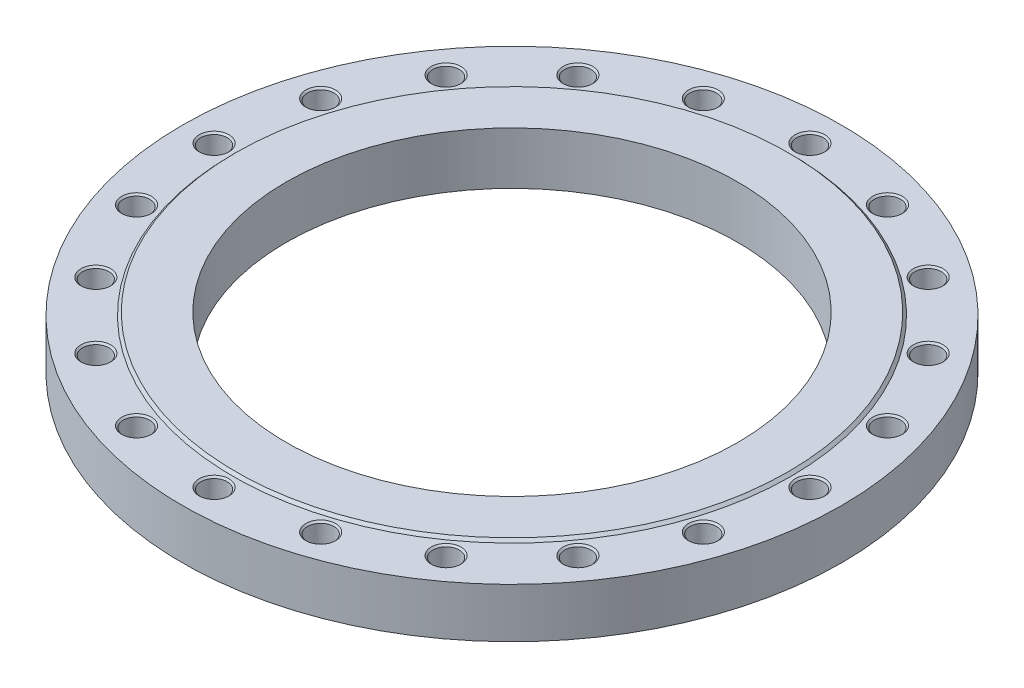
ISO-10303-21;
HEADER;
FILE_DESCRIPTION(('STEP AP214'),'2;1');
FILE_NAME('part.step','',(''),(''),'','','');
FILE_SCHEMA(('AUTOMOTIVE_DESIGN { 1 0 10303 214 1 1 1 1 }'));
ENDSEC;
DATA;
#1=APPLICATION_CONTEXT('core data for automotive mechanical design processes');
#2=APPLICATION_PROTOCOL_DEFINITION('international standard','automotive_design',2000,#1);
#3=PRODUCT_CONTEXT('',#1,'mechanical');
#4=PRODUCT('Part','Part','',(#3));
#5=PRODUCT_RELATED_PRODUCT_CATEGORY('part','',(#4));
#6=PRODUCT_DEFINITION_FORMATION('','',#4);
#7=PRODUCT_DEFINITION_CONTEXT('part definition',#1,'design');
#8=PRODUCT_DEFINITION('design','',#6,#7);
#9=PRODUCT_DEFINITION_SHAPE('','',#8);
#10=(LENGTH_UNIT() NAMED_UNIT(*) SI_UNIT(.MILLI.,.METRE.));
#11=(NAMED_UNIT(*) PLANE_ANGLE_UNIT() SI_UNIT($,.RADIAN.));
#12=(NAMED_UNIT(*) SI_UNIT($,.STERADIAN.) SOLID_ANGLE_UNIT());
#13=UNCERTAINTY_MEASURE_WITH_UNIT(LENGTH_MEASURE(1.E-05),#10,'distance_accuracy_value','');
#14=(GEOMETRIC_REPRESENTATION_CONTEXT(3) GLOBAL_UNCERTAINTY_ASSIGNED_CONTEXT((#13)) GLOBAL_UNIT_ASSIGNED_CONTEXT((#10,
#11,#12)) REPRESENTATION_CONTEXT('',''));
#15=CARTESIAN_POINT('',(0.,0.,0.));
#16=DIRECTION('',(0.,0.,1.));
#17=DIRECTION('',(1.,0.,0.));
#18=AXIS2_PLACEMENT_3D('',#15,#16,#17);
#19=CARTESIAN_POINT('',(0.,27.5,0.));
#20=DIRECTION('',(0.,-1.,0.));
#21=DIRECTION('',(1.,0.,0.));
#22=AXIS2_PLACEMENT_3D('',#19,#20,#21);
#23=CYLINDRICAL_SURFACE('',#22,365.);
#24=CARTESIAN_POINT('',(0.,0.,0.));
#25=DIRECTION('',(0.,1.,0.));
#26=DIRECTION('',(1.,0.,0.));
#27=AXIS2_PLACEMENT_3D('',#24,#25,#26);
#28=CIRCLE('',#27,365.);
#29=CARTESIAN_POINT('',(365.,0.,0.));
#30=VERTEX_POINT('',#29);
#31=EDGE_CURVE('E9',#30,#30,#28,.T.);
#32=ORIENTED_EDGE('',*,*,#31,.T.);
#33=EDGE_LOOP('',(#32));
#34=FACE_BOUND('',#33,.T.);
#35=CARTESIAN_POINT('',(0.,55.,0.));
#36=DIRECTION('',(0.,1.,0.));
#37=DIRECTION('',(1.,0.,0.));
#38=AXIS2_PLACEMENT_3D('',#35,#36,#37);
#39=CIRCLE('',#38,365.);
#40=CARTESIAN_POINT('',(365.,55.,0.));
#41=VERTEX_POINT('',#40);
#42=EDGE_CURVE('E565',#41,#41,#39,.T.);
#43=ORIENTED_EDGE('',*,*,#42,.F.);
#44=EDGE_LOOP('',(#43));
#45=FACE_BOUND('',#44,.T.);
#46=ADVANCED_FACE('F15',(#34,#45),#23,.T.);
#47=CARTESIAN_POINT('',(307.5,0.,0.));
#48=DIRECTION('',(0.,-1.,0.));
#49=DIRECTION('',(-1.,0.,0.));
#50=AXIS2_PLACEMENT_3D('',#47,#48,#49);
#51=PLANE('',#50);
#52=CARTESIAN_POINT('',(0.,0.,0.));
#53=DIRECTION('',(0.,1.,0.));
#54=DIRECTION('',(1.,0.,0.));
#55=AXIS2_PLACEMENT_3D('',#52,#53,#54);
#56=CIRCLE('',#55,250.);
#57=CARTESIAN_POINT('',(250.,0.,0.));
#58=VERTEX_POINT('',#57);
#59=EDGE_CURVE('E23',#58,#58,#56,.T.);
#60=ORIENTED_EDGE('',*,*,#59,.T.);
#61=EDGE_LOOP('',(#60));
#62=FACE_BOUND('',#61,.T.);
#63=ORIENTED_EDGE('',*,*,#31,.F.);
#64=EDGE_LOOP('',(#63));
#65=FACE_BOUND('',#64,.T.);
#66=ADVANCED_FACE('F700',(#62,#65),#51,.T.);
#67=CARTESIAN_POINT('',(0.,29.,0.));
#68=DIRECTION('',(0.,-1.,0.));
#69=DIRECTION('',(1.,0.,0.));
#70=AXIS2_PLACEMENT_3D('',#67,#68,#69);
#71=CYLINDRICAL_SURFACE('',#70,250.);
#72=CARTESIAN_POINT('',(0.,58.,0.));
#73=DIRECTION('',(0.,1.,0.));
#74=DIRECTION('',(1.,0.,0.));
#75=AXIS2_PLACEMENT_3D('',#72,#73,#74);
#76=CIRCLE('',#75,250.);
#77=CARTESIAN_POINT('',(250.,58.,0.));
#78=VERTEX_POINT('',#77);
#79=EDGE_CURVE('E564',#78,#78,#76,.T.);
#80=ORIENTED_EDGE('',*,*,#79,.T.);
#81=EDGE_LOOP('',(#80));
#82=FACE_BOUND('',#81,.T.);
#83=ORIENTED_EDGE('',*,*,#59,.F.);
#84=EDGE_LOOP('',(#83));
#85=FACE_BOUND('',#84,.T.);
#86=ADVANCED_FACE('F17',(#82,#85),#71,.F.);
#87=CARTESIAN_POINT('',(278.,58.,0.));
#88=DIRECTION('',(0.,1.,0.));
#89=DIRECTION('',(1.,0.,0.));
#90=AXIS2_PLACEMENT_3D('',#87,#88,#89);
#91=PLANE('',#90);
#92=CARTESIAN_POINT('',(0.,58.,0.));
#93=DIRECTION('',(0.,1.,0.));
#94=DIRECTION('',(1.,0.,0.));
#95=AXIS2_PLACEMENT_3D('',#92,#93,#94);
#96=CIRCLE('',#95,306.);
#97=CARTESIAN_POINT('',(306.,58.,0.));
#98=VERTEX_POINT('',#97);
#99=EDGE_CURVE('E562',#98,#98,#96,.T.);
#100=ORIENTED_EDGE('',*,*,#99,.T.);
#101=EDGE_LOOP('',(#100));
#102=FACE_BOUND('',#101,.T.);
#103=ORIENTED_EDGE('',*,*,#79,.F.);
#104=EDGE_LOOP('',(#103));
#105=FACE_BOUND('',#104,.T.);
#106=ADVANCED_FACE('F1838',(#102,#105),#91,.T.);
#107=CARTESIAN_POINT('',(0.,56.5,0.));
#108=DIRECTION('',(0.,-1.,0.));
#109=DIRECTION('',(1.,0.,0.));
#110=AXIS2_PLACEMENT_3D('',#107,#108,#109);
#111=CONICAL_SURFACE('',#110,307.5,0.785398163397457);
#112=CARTESIAN_POINT('',(0.,55.,0.));
#113=DIRECTION('',(0.,1.,0.));
#114=DIRECTION('',(1.,0.,0.));
#115=AXIS2_PLACEMENT_3D('',#112,#113,#114);
#116=CIRCLE('',#115,309.);
#117=CARTESIAN_POINT('',(309.,55.,0.));
#118=VERTEX_POINT('',#117);
#119=EDGE_CURVE('E508',#118,#118,#116,.T.);
#120=ORIENTED_EDGE('',*,*,#119,.T.);
#121=EDGE_LOOP('',(#120));
#122=FACE_BOUND('',#121,.T.);
#123=ORIENTED_EDGE('',*,*,#99,.F.);
#124=EDGE_LOOP('',(#123));
#125=FACE_BOUND('',#124,.T.);
#126=ADVANCED_FACE('F1836',(#122,#125),#111,.T.);
#127=CARTESIAN_POINT('',(337.,55.,0.));
#128=DIRECTION('',(0.,1.,0.));
#129=DIRECTION('',(1.,0.,0.));
#130=AXIS2_PLACEMENT_3D('',#127,#128,#129);
#131=PLANE('',#130);
#132=ORIENTED_EDGE('',*,*,#42,.T.);
#133=EDGE_LOOP('',(#132));
#134=FACE_BOUND('',#133,.T.);
#135=ORIENTED_EDGE('',*,*,#119,.F.);
#136=EDGE_LOOP('',(#135));
#137=FACE_BOUND('',#136,.T.);
#138=CARTESIAN_POINT('',(330.,55.,0.));
#139=DIRECTION('',(0.,-1.,0.));
#140=DIRECTION('',(1.,0.,0.));
#141=AXIS2_PLACEMENT_3D('',#138,#139,#140);
#142=CIRCLE('',#141,16.5);
#143=CARTESIAN_POINT('',(346.5,55.,0.));
#144=VERTEX_POINT('',#143);
#145=EDGE_CURVE('E571',#144,#144,#142,.T.);
#146=ORIENTED_EDGE('',*,*,#145,.T.);
#147=EDGE_LOOP('',(#146));
#148=FACE_BOUND('',#147,.T.);
#149=CARTESIAN_POINT('',(313.848650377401,55.,-101.975608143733));
#150=DIRECTION('',(0.,-1.,0.));
#151=DIRECTION('',(0.951056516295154,0.,-0.309016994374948));
#152=AXIS2_PLACEMENT_3D('',#149,#150,#151);
#153=CIRCLE('',#152,16.5);
#154=CARTESIAN_POINT('',(329.54108289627,55.,-107.074388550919));
#155=VERTEX_POINT('',#154);
#156=EDGE_CURVE('E532',#155,#155,#153,.T.);
#157=ORIENTED_EDGE('',*,*,#156,.T.);
#158=EDGE_LOOP('',(#157));
#159=FACE_BOUND('',#158,.T.);
#160=CARTESIAN_POINT('',(266.975608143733,55.,-193.969133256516));
#161=DIRECTION('',(0.,-1.,0.));
#162=DIRECTION('',(0.809016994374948,0.,-0.587785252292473));
#163=AXIS2_PLACEMENT_3D('',#160,#161,#162);
#164=CIRCLE('',#163,16.5);
#165=CARTESIAN_POINT('',(280.324388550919,55.,-203.667589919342));
#166=VERTEX_POINT('',#165);
#167=EDGE_CURVE('E512',#166,#166,#164,.T.);
#168=ORIENTED_EDGE('',*,*,#167,.T.);
#169=EDGE_LOOP('',(#168));
#170=FACE_BOUND('',#169,.T.);
#171=CARTESIAN_POINT('',(193.969133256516,55.,-266.975608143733));
#172=DIRECTION('',(0.,-1.,0.));
#173=DIRECTION('',(0.587785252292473,0.,-0.809016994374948));
#174=AXIS2_PLACEMENT_3D('',#171,#172,#173);
#175=CIRCLE('',#174,16.5);
#176=CARTESIAN_POINT('',(203.667589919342,55.,-280.324388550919));
#177=VERTEX_POINT('',#176);
#178=EDGE_CURVE('E468',#177,#177,#175,.T.);
#179=ORIENTED_EDGE('',*,*,#178,.T.);
#180=EDGE_LOOP('',(#179));
#181=FACE_BOUND('',#180,.T.);
#182=CARTESIAN_POINT('',(101.975608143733,55.,-313.848650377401));
#183=DIRECTION('',(0.,-1.,0.));
#184=DIRECTION('',(0.309016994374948,0.,-0.951056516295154));
#185=AXIS2_PLACEMENT_3D('',#182,#183,#184);
#186=CIRCLE('',#185,16.5);
#187=CARTESIAN_POINT('',(107.074388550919,55.,-329.54108289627));
#188=VERTEX_POINT('',#187);
#189=EDGE_CURVE('E604',#188,#188,#186,.T.);
#190=ORIENTED_EDGE('',*,*,#189,.T.);
#191=EDGE_LOOP('',(#190));
#192=FACE_BOUND('',#191,.T.);
#193=CARTESIAN_POINT('',(0.,55.,-330.));
#194=DIRECTION('',(0.,-1.,0.));
#195=DIRECTION('',(0.,0.,-1.));
#196=AXIS2_PLACEMENT_3D('',#193,#194,#195);
#197=CIRCLE('',#196,16.5);
#198=CARTESIAN_POINT('',(0.,55.,-346.5));
#199=VERTEX_POINT('',#198);
#200=EDGE_CURVE('E488',#199,#199,#197,.T.);
#201=ORIENTED_EDGE('',*,*,#200,.T.);
#202=EDGE_LOOP('',(#201));
#203=FACE_BOUND('',#202,.T.);
#204=CARTESIAN_POINT('',(-101.975608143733,55.,-313.848650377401));
#205=DIRECTION('',(0.,-1.,0.));
#206=DIRECTION('',(-0.309016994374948,0.,-0.951056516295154));
#207=AXIS2_PLACEMENT_3D('',#204,#205,#206);
#208=CIRCLE('',#207,16.5);
#209=CARTESIAN_POINT('',(-107.074388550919,55.,-329.54108289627));
#210=VERTEX_POINT('',#209);
#211=EDGE_CURVE('E577',#210,#210,#208,.T.);
#212=ORIENTED_EDGE('',*,*,#211,.T.);
#213=EDGE_LOOP('',(#212));
#214=FACE_BOUND('',#213,.T.);
#215=CARTESIAN_POINT('',(-193.969133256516,55.,-266.975608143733));
#216=DIRECTION('',(0.,-1.,0.));
#217=DIRECTION('',(-0.587785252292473,0.,-0.809016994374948));
#218=AXIS2_PLACEMENT_3D('',#215,#216,#217);
#219=CIRCLE('',#218,16.5);
#220=CARTESIAN_POINT('',(-203.667589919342,55.,-280.324388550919));
#221=VERTEX_POINT('',#220);
#222=EDGE_CURVE('E555',#221,#221,#219,.T.);
#223=ORIENTED_EDGE('',*,*,#222,.T.);
#224=EDGE_LOOP('',(#223));
#225=FACE_BOUND('',#224,.T.);
#226=CARTESIAN_POINT('',(-266.975608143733,55.,-193.969133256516));
#227=DIRECTION('',(0.,-1.,0.));
#228=DIRECTION('',(-0.809016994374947,0.,-0.587785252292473));
#229=AXIS2_PLACEMENT_3D('',#226,#227,#228);
#230=CIRCLE('',#229,16.5);
#231=CARTESIAN_POINT('',(-280.324388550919,55.,-203.667589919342));
#232=VERTEX_POINT('',#231);
#233=EDGE_CURVE('E494',#232,#232,#230,.T.);
#234=ORIENTED_EDGE('',*,*,#233,.T.);
#235=EDGE_LOOP('',(#234));
#236=FACE_BOUND('',#235,.T.);
#237=CARTESIAN_POINT('',(-313.848650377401,55.,-101.975608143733));
#238=DIRECTION('',(0.,-1.,0.));
#239=DIRECTION('',(-0.951056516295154,0.,-0.309016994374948));
#240=AXIS2_PLACEMENT_3D('',#237,#238,#239);
#241=CIRCLE('',#240,16.5);
#242=CARTESIAN_POINT('',(-329.54108289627,55.,-107.074388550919));
#243=VERTEX_POINT('',#242);
#244=EDGE_CURVE('E615',#243,#243,#241,.T.);
#245=ORIENTED_EDGE('',*,*,#244,.T.);
#246=EDGE_LOOP('',(#245));
#247=FACE_BOUND('',#246,.T.);
#248=CARTESIAN_POINT('',(-330.,55.,0.));
#249=DIRECTION('',(0.,-1.,0.));
#250=DIRECTION('',(-1.,0.,0.));
#251=AXIS2_PLACEMENT_3D('',#248,#249,#250);
#252=CIRCLE('',#251,16.5);
#253=CARTESIAN_POINT('',(-346.5,55.,0.));
#254=VERTEX_POINT('',#253);
#255=EDGE_CURVE('E597',#254,#254,#252,.T.);
#256=ORIENTED_EDGE('',*,*,#255,.T.);
#257=EDGE_LOOP('',(#256));
#258=FACE_BOUND('',#257,.T.);
#259=CARTESIAN_POINT('',(-313.848650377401,55.,101.975608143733));
#260=DIRECTION('',(0.,-1.,0.));
#261=DIRECTION('',(-0.951056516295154,0.,0.309016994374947));
#262=AXIS2_PLACEMENT_3D('',#259,#260,#261);
#263=CIRCLE('',#262,16.5);
#264=CARTESIAN_POINT('',(-329.54108289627,55.,107.074388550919));
#265=VERTEX_POINT('',#264);
#266=EDGE_CURVE('E580',#265,#265,#263,.T.);
#267=ORIENTED_EDGE('',*,*,#266,.T.);
#268=EDGE_LOOP('',(#267));
#269=FACE_BOUND('',#268,.T.);
#270=CARTESIAN_POINT('',(-266.975608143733,55.,193.969133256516));
#271=DIRECTION('',(0.,-1.,0.));
#272=DIRECTION('',(-0.809016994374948,0.,0.587785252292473));
#273=AXIS2_PLACEMENT_3D('',#270,#271,#272);
#274=CIRCLE('',#273,16.5);
#275=CARTESIAN_POINT('',(-280.324388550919,55.,203.667589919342));
#276=VERTEX_POINT('',#275);
#277=EDGE_CURVE('E551',#276,#276,#274,.T.);
#278=ORIENTED_EDGE('',*,*,#277,.T.);
#279=EDGE_LOOP('',(#278));
#280=FACE_BOUND('',#279,.T.);
#281=CARTESIAN_POINT('',(-193.969133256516,55.,266.975608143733));
#282=DIRECTION('',(0.,-1.,0.));
#283=DIRECTION('',(-0.587785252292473,0.,0.809016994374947));
#284=AXIS2_PLACEMENT_3D('',#281,#282,#283);
#285=CIRCLE('',#284,16.5);
#286=CARTESIAN_POINT('',(-203.667589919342,55.,280.324388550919));
#287=VERTEX_POINT('',#286);
#288=EDGE_CURVE('E481',#287,#287,#285,.T.);
#289=ORIENTED_EDGE('',*,*,#288,.T.);
#290=EDGE_LOOP('',(#289));
#291=FACE_BOUND('',#290,.T.);
#292=CARTESIAN_POINT('',(-101.975608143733,55.,313.848650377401));
#293=DIRECTION('',(0.,-1.,0.));
#294=DIRECTION('',(-0.309016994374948,0.,0.951056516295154));
#295=AXIS2_PLACEMENT_3D('',#292,#293,#294);
#296=CIRCLE('',#295,16.5);
#297=CARTESIAN_POINT('',(-107.074388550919,55.,329.54108289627));
#298=VERTEX_POINT('',#297);
#299=EDGE_CURVE('E522',#298,#298,#296,.T.);
#300=ORIENTED_EDGE('',*,*,#299,.T.);
#301=EDGE_LOOP('',(#300));
#302=FACE_BOUND('',#301,.T.);
#303=CARTESIAN_POINT('',(0.,55.,330.));
#304=DIRECTION('',(0.,-1.,0.));
#305=DIRECTION('',(0.,0.,1.));
#306=AXIS2_PLACEMENT_3D('',#303,#304,#305);
#307=CIRCLE('',#306,16.5);
#308=CARTESIAN_POINT('',(0.,55.,346.5));
#309=VERTEX_POINT('',#308);
#310=EDGE_CURVE('E499',#309,#309,#307,.T.);
#311=ORIENTED_EDGE('',*,*,#310,.T.);
#312=EDGE_LOOP('',(#311));
#313=FACE_BOUND('',#312,.T.);
#314=CARTESIAN_POINT('',(101.975608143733,55.,313.848650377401));
#315=DIRECTION('',(0.,-1.,0.));
#316=DIRECTION('',(0.309016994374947,0.,0.951056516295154));
#317=AXIS2_PLACEMENT_3D('',#314,#315,#316);
#318=CIRCLE('',#317,16.5);
#319=CARTESIAN_POINT('',(107.074388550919,55.,329.54108289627));
#320=VERTEX_POINT('',#319);
#321=EDGE_CURVE('E476',#320,#320,#318,.T.);
#322=ORIENTED_EDGE('',*,*,#321,.T.);
#323=EDGE_LOOP('',(#322));
#324=FACE_BOUND('',#323,.T.);
#325=CARTESIAN_POINT('',(193.969133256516,55.,266.975608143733));
#326=DIRECTION('',(0.,-1.,0.));
#327=DIRECTION('',(0.587785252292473,0.,0.809016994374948));
#328=AXIS2_PLACEMENT_3D('',#325,#326,#327);
#329=CIRCLE('',#328,16.5);
#330=CARTESIAN_POINT('',(203.667589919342,55.,280.324388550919));
#331=VERTEX_POINT('',#330);
#332=EDGE_CURVE('E1889',#331,#331,#329,.T.);
#333=ORIENTED_EDGE('',*,*,#332,.T.);
#334=EDGE_LOOP('',(#333));
#335=FACE_BOUND('',#334,.T.);
#336=CARTESIAN_POINT('',(266.975608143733,55.,193.969133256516));
#337=DIRECTION('',(0.,-1.,0.));
#338=DIRECTION('',(0.809016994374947,0.,0.587785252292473));
#339=AXIS2_PLACEMENT_3D('',#336,#337,#338);
#340=CIRCLE('',#339,16.5);
#341=CARTESIAN_POINT('',(280.324388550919,55.,203.667589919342));
#342=VERTEX_POINT('',#341);
#343=EDGE_CURVE('E1892',#342,#342,#340,.T.);
#344=ORIENTED_EDGE('',*,*,#343,.T.);
#345=EDGE_LOOP('',(#344));
#346=FACE_BOUND('',#345,.T.);
#347=CARTESIAN_POINT('',(313.848650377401,55.,101.975608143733));
#348=DIRECTION('',(0.,-1.,0.));
#349=DIRECTION('',(0.951056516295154,0.,0.309016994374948));
#350=AXIS2_PLACEMENT_3D('',#347,#348,#349);
#351=CIRCLE('',#350,16.5);
#352=CARTESIAN_POINT('',(329.54108289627,55.,107.074388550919));
#353=VERTEX_POINT('',#352);
#354=EDGE_CURVE('E1893',#353,#353,#351,.T.);
#355=ORIENTED_EDGE('',*,*,#354,.T.);
#356=EDGE_LOOP('',(#355));
#357=FACE_BOUND('',#356,.T.);
#358=ADVANCED_FACE('F766',(#134,#137,#148,#159,#170,#181,#192,#203,#214,#225,#236,#247,#258,
#269,#280,#291,#302,#313,#324,#335,#346,#357),#131,.T.);
#359=CARTESIAN_POINT('',(330.,7.78371923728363,0.));
#360=DIRECTION('',(0.,1.,0.));
#361=DIRECTION('',(1.,0.,0.));
#362=AXIS2_PLACEMENT_3D('',#359,#360,#361);
#363=CONICAL_SURFACE('',#362,7.3028125,1.0471975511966);
#364=CARTESIAN_POINT('',(330.,12.,0.));
#365=DIRECTION('',(0.,-1.,0.));
#366=DIRECTION('',(1.,0.,0.));
#367=AXIS2_PLACEMENT_3D('',#364,#365,#366);
#368=CIRCLE('',#367,14.605625);
#369=CARTESIAN_POINT('',(344.605625,12.,0.));
#370=VERTEX_POINT('',#369);
#371=EDGE_CURVE('E506',#370,#370,#368,.T.);
#372=ORIENTED_EDGE('',*,*,#371,.F.);
#373=EDGE_LOOP('',(#372));
#374=FACE_BOUND('',#373,.T.);
#375=CARTESIAN_POINT('',(330.,3.56743847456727,0.));
#376=VERTEX_POINT('',#375);
#377=VERTEX_LOOP('',#376);
#378=FACE_BOUND('',#377,.T.);
#379=ADVANCED_FACE('F763',(#374,#378),#363,.F.);
#380=CARTESIAN_POINT('',(330.,16.5528125,0.));
#381=DIRECTION('',(0.,1.,0.));
#382=DIRECTION('',(1.,0.,0.));
#383=AXIS2_PLACEMENT_3D('',#380,#381,#382);
#384=CYLINDRICAL_SURFACE('',#383,14.605625);
#385=CARTESIAN_POINT('',(330.,21.105625,0.));
#386=DIRECTION('',(0.,-1.,0.));
#387=DIRECTION('',(1.,0.,0.));
#388=AXIS2_PLACEMENT_3D('',#385,#386,#387);
#389=CIRCLE('',#388,14.605625);
#390=CARTESIAN_POINT('',(344.605625,21.105625,0.));
#391=VERTEX_POINT('',#390);
#392=EDGE_CURVE('E509',#391,#391,#389,.T.);
#393=ORIENTED_EDGE('',*,*,#392,.F.);
#394=EDGE_LOOP('',(#393));
#395=FACE_BOUND('',#394,.T.);
#396=ORIENTED_EDGE('',*,*,#371,.T.);
#397=EDGE_LOOP('',(#396));
#398=FACE_BOUND('',#397,.T.);
#399=ADVANCED_FACE('F765',(#395,#398),#384,.F.);
#400=CARTESIAN_POINT('',(330.,22.0528125,0.));
#401=DIRECTION('',(0.,1.,0.));
#402=DIRECTION('',(1.,0.,0.));
#403=AXIS2_PLACEMENT_3D('',#400,#401,#402);
#404=CONICAL_SURFACE('',#403,15.5528125,0.785398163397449);
#405=CARTESIAN_POINT('',(330.,23.,0.));
#406=DIRECTION('',(0.,-1.,0.));
#407=DIRECTION('',(1.,0.,0.));
#408=AXIS2_PLACEMENT_3D('',#405,#406,#407);
#409=CIRCLE('',#408,16.5);
#410=CARTESIAN_POINT('',(346.5,23.,0.));
#411=VERTEX_POINT('',#410);
#412=EDGE_CURVE('E657',#411,#411,#409,.T.);
#413=ORIENTED_EDGE('',*,*,#412,.F.);
#414=EDGE_LOOP('',(#413));
#415=FACE_BOUND('',#414,.T.);
#416=ORIENTED_EDGE('',*,*,#392,.T.);
#417=EDGE_LOOP('',(#416));
#418=FACE_BOUND('',#417,.T.);
#419=ADVANCED_FACE('F861',(#415,#418),#404,.F.);
#420=CARTESIAN_POINT('',(345.5528125,23.,0.));
#421=DIRECTION('',(0.,1.,0.));
#422=DIRECTION('',(-1.,0.,0.));
#423=AXIS2_PLACEMENT_3D('',#420,#421,#422);
#424=PLANE('',#423);
#425=CARTESIAN_POINT('',(330.,23.,0.));
#426=DIRECTION('',(0.,-1.,0.));
#427=DIRECTION('',(1.,0.,0.));
#428=AXIS2_PLACEMENT_3D('',#425,#426,#427);
#429=CIRCLE('',#428,14.605625);
#430=CARTESIAN_POINT('',(344.605625,23.,0.));
#431=VERTEX_POINT('',#430);
#432=EDGE_CURVE('E573',#431,#431,#429,.T.);
#433=ORIENTED_EDGE('',*,*,#432,.F.);
#434=EDGE_LOOP('',(#433));
#435=FACE_BOUND('',#434,.T.);
#436=ORIENTED_EDGE('',*,*,#412,.T.);
#437=EDGE_LOOP('',(#436));
#438=FACE_BOUND('',#437,.T.);
#439=ADVANCED_FACE('F730',(#435,#438),#424,.F.);
#440=CARTESIAN_POINT('',(330.,38.0528125,0.));
#441=DIRECTION('',(0.,1.,0.));
#442=DIRECTION('',(1.,0.,0.));
#443=AXIS2_PLACEMENT_3D('',#440,#441,#442);
#444=CYLINDRICAL_SURFACE('',#443,14.605625);
#445=CARTESIAN_POINT('',(330.,53.105625,0.));
#446=DIRECTION('',(0.,-1.,0.));
#447=DIRECTION('',(1.,0.,0.));
#448=AXIS2_PLACEMENT_3D('',#445,#446,#447);
#449=CIRCLE('',#448,14.605625);
#450=CARTESIAN_POINT('',(344.605625,53.105625,0.));
#451=VERTEX_POINT('',#450);
#452=EDGE_CURVE('E574',#451,#451,#449,.T.);
#453=ORIENTED_EDGE('',*,*,#452,.F.);
#454=EDGE_LOOP('',(#453));
#455=FACE_BOUND('',#454,.T.);
#456=ORIENTED_EDGE('',*,*,#432,.T.);
#457=EDGE_LOOP('',(#456));
#458=FACE_BOUND('',#457,.T.);
#459=ADVANCED_FACE('F726',(#455,#458),#444,.F.);
#460=CARTESIAN_POINT('',(330.,54.0528125,0.));
#461=DIRECTION('',(0.,1.,0.));
#462=DIRECTION('',(1.,0.,0.));
#463=AXIS2_PLACEMENT_3D('',#460,#461,#462);
#464=CONICAL_SURFACE('',#463,15.5528125,0.785398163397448);
#465=ORIENTED_EDGE('',*,*,#145,.F.);
#466=EDGE_LOOP('',(#465));
#467=FACE_BOUND('',#466,.T.);
#468=ORIENTED_EDGE('',*,*,#452,.T.);
#469=EDGE_LOOP('',(#468));
#470=FACE_BOUND('',#469,.T.);
#471=ADVANCED_FACE('F729',(#467,#470),#464,.F.);
#472=CARTESIAN_POINT('',(313.848650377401,7.78371923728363,-101.975608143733));
#473=DIRECTION('',(0.,1.,0.));
#474=DIRECTION('',(0.951056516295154,0.,-0.309016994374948));
#475=AXIS2_PLACEMENT_3D('',#472,#473,#474);
#476=CONICAL_SURFACE('',#475,7.3028125,1.0471975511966);
#477=CARTESIAN_POINT('',(313.848650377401,12.,-101.975608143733));
#478=DIRECTION('',(0.,-1.,0.));
#479=DIRECTION('',(0.951056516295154,0.,-0.309016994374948));
#480=AXIS2_PLACEMENT_3D('',#477,#478,#479);
#481=CIRCLE('',#480,14.605625);
#482=CARTESIAN_POINT('',(327.739425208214,12.,-106.4889944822));
#483=VERTEX_POINT('',#482);
#484=EDGE_CURVE('E620',#483,#483,#481,.T.);
#485=ORIENTED_EDGE('',*,*,#484,.F.);
#486=EDGE_LOOP('',(#485));
#487=FACE_BOUND('',#486,.T.);
#488=CARTESIAN_POINT('',(313.848650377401,3.56743847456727,-101.975608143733));
#489=VERTEX_POINT('',#488);
#490=VERTEX_LOOP('',#489);
#491=FACE_BOUND('',#490,.T.);
#492=ADVANCED_FACE('F749',(#487,#491),#476,.F.);
#493=CARTESIAN_POINT('',(313.848650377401,16.5528125,-101.975608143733));
#494=DIRECTION('',(0.,1.,0.));
#495=DIRECTION('',(0.951056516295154,0.,-0.309016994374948));
#496=AXIS2_PLACEMENT_3D('',#493,#494,#495);
#497=CYLINDRICAL_SURFACE('',#496,14.605625);
#498=CARTESIAN_POINT('',(313.848650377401,21.105625,-101.975608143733));
#499=DIRECTION('',(0.,-1.,0.));
#500=DIRECTION('',(0.951056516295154,0.,-0.309016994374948));
#501=AXIS2_PLACEMENT_3D('',#498,#499,#500);
#502=CIRCLE('',#501,14.605625);
#503=CARTESIAN_POINT('',(327.739425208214,21.105625,-106.4889944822));
#504=VERTEX_POINT('',#503);
#505=EDGE_CURVE('E647',#504,#504,#502,.T.);
#506=ORIENTED_EDGE('',*,*,#505,.F.);
#507=EDGE_LOOP('',(#506));
#508=FACE_BOUND('',#507,.T.);
#509=ORIENTED_EDGE('',*,*,#484,.T.);
#510=EDGE_LOOP('',(#509));
#511=FACE_BOUND('',#510,.T.);
#512=ADVANCED_FACE('F745',(#508,#511),#497,.F.);
#513=CARTESIAN_POINT('',(313.848650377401,22.0528125,-101.975608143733));
#514=DIRECTION('',(0.,1.,0.));
#515=DIRECTION('',(0.951056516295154,0.,-0.309016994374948));
#516=AXIS2_PLACEMENT_3D('',#513,#514,#515);
#517=CONICAL_SURFACE('',#516,15.5528125,0.785398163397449);
#518=CARTESIAN_POINT('',(313.848650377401,23.,-101.975608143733));
#519=DIRECTION('',(0.,-1.,0.));
#520=DIRECTION('',(0.951056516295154,0.,-0.309016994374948));
#521=AXIS2_PLACEMENT_3D('',#518,#519,#520);
#522=CIRCLE('',#521,16.5);
#523=CARTESIAN_POINT('',(329.54108289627,23.,-107.074388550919));
#524=VERTEX_POINT('',#523);
#525=EDGE_CURVE('E531',#524,#524,#522,.T.);
#526=ORIENTED_EDGE('',*,*,#525,.F.);
#527=EDGE_LOOP('',(#526));
#528=FACE_BOUND('',#527,.T.);
#529=ORIENTED_EDGE('',*,*,#505,.T.);
#530=EDGE_LOOP('',(#529));
#531=FACE_BOUND('',#530,.T.);
#532=ADVANCED_FACE('F748',(#528,#531),#517,.F.);
#533=CARTESIAN_POINT('',(328.640254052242,23.,-106.78169151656));
#534=DIRECTION('',(0.,1.,0.));
#535=DIRECTION('',(-0.951056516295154,0.,0.309016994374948));
#536=AXIS2_PLACEMENT_3D('',#533,#534,#535);
#537=PLANE('',#536);
#538=CARTESIAN_POINT('',(313.848650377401,23.,-101.975608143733));
#539=DIRECTION('',(0.,-1.,0.));
#540=DIRECTION('',(0.951056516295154,0.,-0.309016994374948));
#541=AXIS2_PLACEMENT_3D('',#538,#539,#540);
#542=CIRCLE('',#541,14.605625);
#543=CARTESIAN_POINT('',(327.739425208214,23.,-106.4889944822));
#544=VERTEX_POINT('',#543);
#545=EDGE_CURVE('E529',#544,#544,#542,.T.);
#546=ORIENTED_EDGE('',*,*,#545,.F.);
#547=EDGE_LOOP('',(#546));
#548=FACE_BOUND('',#547,.T.);
#549=ORIENTED_EDGE('',*,*,#525,.T.);
#550=EDGE_LOOP('',(#549));
#551=FACE_BOUND('',#550,.T.);
#552=ADVANCED_FACE('F827',(#548,#551),#537,.F.);
#553=CARTESIAN_POINT('',(313.848650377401,38.0528125,-101.975608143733));
#554=DIRECTION('',(0.,1.,0.));
#555=DIRECTION('',(0.951056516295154,0.,-0.309016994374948));
#556=AXIS2_PLACEMENT_3D('',#553,#554,#555);
#557=CYLINDRICAL_SURFACE('',#556,14.605625);
#558=CARTESIAN_POINT('',(313.848650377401,53.105625,-101.975608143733));
#559=DIRECTION('',(0.,-1.,0.));
#560=DIRECTION('',(0.951056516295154,0.,-0.309016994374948));
#561=AXIS2_PLACEMENT_3D('',#558,#559,#560);
#562=CIRCLE('',#561,14.605625);
#563=CARTESIAN_POINT('',(327.739425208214,53.105625,-106.4889944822));
#564=VERTEX_POINT('',#563);
#565=EDGE_CURVE('E568',#564,#564,#562,.T.);
#566=ORIENTED_EDGE('',*,*,#565,.F.);
#567=EDGE_LOOP('',(#566));
#568=FACE_BOUND('',#567,.T.);
#569=ORIENTED_EDGE('',*,*,#545,.T.);
#570=EDGE_LOOP('',(#569));
#571=FACE_BOUND('',#570,.T.);
#572=ADVANCED_FACE('F830',(#568,#571),#557,.F.);
#573=CARTESIAN_POINT('',(313.848650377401,54.0528125,-101.975608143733));
#574=DIRECTION('',(0.,1.,0.));
#575=DIRECTION('',(0.951056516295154,0.,-0.309016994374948));
#576=AXIS2_PLACEMENT_3D('',#573,#574,#575);
#577=CONICAL_SURFACE('',#576,15.5528125,0.785398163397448);
#578=ORIENTED_EDGE('',*,*,#156,.F.);
#579=EDGE_LOOP('',(#578));
#580=FACE_BOUND('',#579,.T.);
#581=ORIENTED_EDGE('',*,*,#565,.T.);
#582=EDGE_LOOP('',(#581));
#583=FACE_BOUND('',#582,.T.);
#584=ADVANCED_FACE('F853',(#580,#583),#577,.F.);
#585=CARTESIAN_POINT('',(266.975608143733,7.78371923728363,-193.969133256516));
#586=DIRECTION('',(0.,1.,0.));
#587=DIRECTION('',(0.809016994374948,0.,-0.587785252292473));
#588=AXIS2_PLACEMENT_3D('',#585,#586,#587);
#589=CONICAL_SURFACE('',#588,7.3028125,1.0471975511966);
#590=CARTESIAN_POINT('',(266.975608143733,12.,-193.969133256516));
#591=DIRECTION('',(0.,-1.,0.));
#592=DIRECTION('',(0.809016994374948,0.,-0.587785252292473));
#593=AXIS2_PLACEMENT_3D('',#590,#591,#592);
#594=CIRCLE('',#593,14.605625);
#595=CARTESIAN_POINT('',(278.7918069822,12.,-202.55410423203));
#596=VERTEX_POINT('',#595);
#597=EDGE_CURVE('E566',#596,#596,#594,.T.);
#598=ORIENTED_EDGE('',*,*,#597,.F.);
#599=EDGE_LOOP('',(#598));
#600=FACE_BOUND('',#599,.T.);
#601=CARTESIAN_POINT('',(266.975608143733,3.56743847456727,-193.969133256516));
#602=VERTEX_POINT('',#601);
#603=VERTEX_LOOP('',#602);
#604=FACE_BOUND('',#603,.T.);
#605=ADVANCED_FACE('F856',(#600,#604),#589,.F.);
#606=CARTESIAN_POINT('',(266.975608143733,16.5528125,-193.969133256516));
#607=DIRECTION('',(0.,1.,0.));
#608=DIRECTION('',(0.809016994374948,0.,-0.587785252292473));
#609=AXIS2_PLACEMENT_3D('',#606,#607,#608);
#610=CYLINDRICAL_SURFACE('',#609,14.605625);
#611=CARTESIAN_POINT('',(266.975608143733,21.105625,-193.969133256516));
#612=DIRECTION('',(0.,-1.,0.));
#613=DIRECTION('',(0.809016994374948,0.,-0.587785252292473));
#614=AXIS2_PLACEMENT_3D('',#611,#612,#613);
#615=CIRCLE('',#614,14.605625);
#616=CARTESIAN_POINT('',(278.7918069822,21.105625,-202.55410423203));
#617=VERTEX_POINT('',#616);
#618=EDGE_CURVE('E542',#617,#617,#615,.T.);
#619=ORIENTED_EDGE('',*,*,#618,.F.);
#620=EDGE_LOOP('',(#619));
#621=FACE_BOUND('',#620,.T.);
#622=ORIENTED_EDGE('',*,*,#597,.T.);
#623=EDGE_LOOP('',(#622));
#624=FACE_BOUND('',#623,.T.);
#625=ADVANCED_FACE('F936',(#621,#624),#610,.F.);
#626=CARTESIAN_POINT('',(266.975608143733,22.0528125,-193.969133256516));
#627=DIRECTION('',(0.,1.,0.));
#628=DIRECTION('',(0.809016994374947,0.,-0.587785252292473));
#629=AXIS2_PLACEMENT_3D('',#626,#627,#628);
#630=CONICAL_SURFACE('',#629,15.5528125,0.785398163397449);
#631=CARTESIAN_POINT('',(266.975608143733,23.,-193.969133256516));
#632=DIRECTION('',(0.,-1.,0.));
#633=DIRECTION('',(0.809016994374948,0.,-0.587785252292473));
#634=AXIS2_PLACEMENT_3D('',#631,#632,#633);
#635=CIRCLE('',#634,16.5);
#636=CARTESIAN_POINT('',(280.324388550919,23.,-203.667589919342));
#637=VERTEX_POINT('',#636);
#638=EDGE_CURVE('E540',#637,#637,#635,.T.);
#639=ORIENTED_EDGE('',*,*,#638,.F.);
#640=EDGE_LOOP('',(#639));
#641=FACE_BOUND('',#640,.T.);
#642=ORIENTED_EDGE('',*,*,#618,.T.);
#643=EDGE_LOOP('',(#642));
#644=FACE_BOUND('',#643,.T.);
#645=ADVANCED_FACE('F944',(#641,#644),#630,.F.);
#646=CARTESIAN_POINT('',(279.55809776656,23.,-203.110847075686));
#647=DIRECTION('',(0.,1.,0.));
#648=DIRECTION('',(-0.809016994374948,0.,0.587785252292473));
#649=AXIS2_PLACEMENT_3D('',#646,#647,#648);
#650=PLANE('',#649);
#651=CARTESIAN_POINT('',(266.975608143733,23.,-193.969133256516));
#652=DIRECTION('',(0.,-1.,0.));
#653=DIRECTION('',(0.809016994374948,0.,-0.587785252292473));
#654=AXIS2_PLACEMENT_3D('',#651,#652,#653);
#655=CIRCLE('',#654,14.605625);
#656=CARTESIAN_POINT('',(278.7918069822,23.,-202.55410423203));
#657=VERTEX_POINT('',#656);
#658=EDGE_CURVE('E514',#657,#657,#655,.T.);
#659=ORIENTED_EDGE('',*,*,#658,.F.);
#660=EDGE_LOOP('',(#659));
#661=FACE_BOUND('',#660,.T.);
#662=ORIENTED_EDGE('',*,*,#638,.T.);
#663=EDGE_LOOP('',(#662));
#664=FACE_BOUND('',#663,.T.);
#665=ADVANCED_FACE('F952',(#661,#664),#650,.F.);
#666=CARTESIAN_POINT('',(266.975608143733,38.0528125,-193.969133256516));
#667=DIRECTION('',(0.,1.,0.));
#668=DIRECTION('',(0.809016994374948,0.,-0.587785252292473));
#669=AXIS2_PLACEMENT_3D('',#666,#667,#668);
#670=CYLINDRICAL_SURFACE('',#669,14.605625);
#671=CARTESIAN_POINT('',(266.975608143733,53.105625,-193.969133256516));
#672=DIRECTION('',(0.,-1.,0.));
#673=DIRECTION('',(0.809016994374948,0.,-0.587785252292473));
#674=AXIS2_PLACEMENT_3D('',#671,#672,#673);
#675=CIRCLE('',#674,14.605625);
#676=CARTESIAN_POINT('',(278.7918069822,53.105625,-202.55410423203));
#677=VERTEX_POINT('',#676);
#678=EDGE_CURVE('E515',#677,#677,#675,.T.);
#679=ORIENTED_EDGE('',*,*,#678,.F.);
#680=EDGE_LOOP('',(#679));
#681=FACE_BOUND('',#680,.T.);
#682=ORIENTED_EDGE('',*,*,#658,.T.);
#683=EDGE_LOOP('',(#682));
#684=FACE_BOUND('',#683,.T.);
#685=ADVANCED_FACE('F851',(#681,#684),#670,.F.);
#686=CARTESIAN_POINT('',(266.975608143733,54.0528125,-193.969133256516));
#687=DIRECTION('',(0.,1.,0.));
#688=DIRECTION('',(0.809016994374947,0.,-0.587785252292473));
#689=AXIS2_PLACEMENT_3D('',#686,#687,#688);
#690=CONICAL_SURFACE('',#689,15.5528125,0.785398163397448);
#691=ORIENTED_EDGE('',*,*,#167,.F.);
#692=EDGE_LOOP('',(#691));
#693=FACE_BOUND('',#692,.T.);
#694=ORIENTED_EDGE('',*,*,#678,.T.);
#695=EDGE_LOOP('',(#694));
#696=FACE_BOUND('',#695,.T.);
#697=ADVANCED_FACE('F772',(#693,#696),#690,.F.);
#698=CARTESIAN_POINT('',(193.969133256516,7.78371923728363,-266.975608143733));
#699=DIRECTION('',(0.,1.,0.));
#700=DIRECTION('',(0.587785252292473,0.,-0.809016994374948));
#701=AXIS2_PLACEMENT_3D('',#698,#699,#700);
#702=CONICAL_SURFACE('',#701,7.3028125,1.0471975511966);
#703=CARTESIAN_POINT('',(193.969133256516,12.,-266.975608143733));
#704=DIRECTION('',(0.,-1.,0.));
#705=DIRECTION('',(0.587785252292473,0.,-0.809016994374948));
#706=AXIS2_PLACEMENT_3D('',#703,#704,#705);
#707=CIRCLE('',#706,14.605625);
#708=CARTESIAN_POINT('',(202.55410423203,12.,-278.7918069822));
#709=VERTEX_POINT('',#708);
#710=EDGE_CURVE('E548',#709,#709,#707,.T.);
#711=ORIENTED_EDGE('',*,*,#710,.F.);
#712=EDGE_LOOP('',(#711));
#713=FACE_BOUND('',#712,.T.);
#714=CARTESIAN_POINT('',(193.969133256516,3.56743847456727,-266.975608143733));
#715=VERTEX_POINT('',#714);
#716=VERTEX_LOOP('',#715);
#717=FACE_BOUND('',#716,.T.);
#718=ADVANCED_FACE('F769',(#713,#717),#702,.F.);
#719=CARTESIAN_POINT('',(193.969133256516,16.5528125,-266.975608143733));
#720=DIRECTION('',(0.,1.,0.));
#721=DIRECTION('',(0.587785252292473,0.,-0.809016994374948));
#722=AXIS2_PLACEMENT_3D('',#719,#720,#721);
#723=CYLINDRICAL_SURFACE('',#722,14.605625);
#724=CARTESIAN_POINT('',(193.969133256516,21.105625,-266.975608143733));
#725=DIRECTION('',(0.,-1.,0.));
#726=DIRECTION('',(0.587785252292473,0.,-0.809016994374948));
#727=AXIS2_PLACEMENT_3D('',#724,#725,#726);
#728=CIRCLE('',#727,14.605625);
#729=CARTESIAN_POINT('',(202.55410423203,21.105625,-278.7918069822));
#730=VERTEX_POINT('',#729);
#731=EDGE_CURVE('E470',#730,#730,#728,.T.);
#732=ORIENTED_EDGE('',*,*,#731,.F.);
#733=EDGE_LOOP('',(#732));
#734=FACE_BOUND('',#733,.T.);
#735=ORIENTED_EDGE('',*,*,#710,.T.);
#736=EDGE_LOOP('',(#735));
#737=FACE_BOUND('',#736,.T.);
#738=ADVANCED_FACE('F771',(#734,#737),#723,.F.);
#739=CARTESIAN_POINT('',(193.969133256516,22.0528125,-266.975608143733));
#740=DIRECTION('',(0.,1.,0.));
#741=DIRECTION('',(0.587785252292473,0.,-0.809016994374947));
#742=AXIS2_PLACEMENT_3D('',#739,#740,#741);
#743=CONICAL_SURFACE('',#742,15.5528125,0.785398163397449);
#744=CARTESIAN_POINT('',(193.969133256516,23.,-266.975608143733));
#745=DIRECTION('',(0.,-1.,0.));
#746=DIRECTION('',(0.587785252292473,0.,-0.809016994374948));
#747=AXIS2_PLACEMENT_3D('',#744,#745,#746);
#748=CIRCLE('',#747,16.5);
#749=CARTESIAN_POINT('',(203.667589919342,23.,-280.324388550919));
#750=VERTEX_POINT('',#749);
#751=EDGE_CURVE('E467',#750,#750,#748,.T.);
#752=ORIENTED_EDGE('',*,*,#751,.F.);
#753=EDGE_LOOP('',(#752));
#754=FACE_BOUND('',#753,.T.);
#755=ORIENTED_EDGE('',*,*,#731,.T.);
#756=EDGE_LOOP('',(#755));
#757=FACE_BOUND('',#756,.T.);
#758=ADVANCED_FACE('F844',(#754,#757),#743,.F.);
#759=CARTESIAN_POINT('',(203.110847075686,23.,-279.55809776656));
#760=DIRECTION('',(0.,1.,0.));
#761=DIRECTION('',(-0.587785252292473,0.,0.809016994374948));
#762=AXIS2_PLACEMENT_3D('',#759,#760,#761);
#763=PLANE('',#762);
#764=CARTESIAN_POINT('',(193.969133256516,23.,-266.975608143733));
#765=DIRECTION('',(0.,-1.,0.));
#766=DIRECTION('',(0.587785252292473,0.,-0.809016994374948));
#767=AXIS2_PLACEMENT_3D('',#764,#765,#766);
#768=CIRCLE('',#767,14.605625);
#769=CARTESIAN_POINT('',(202.55410423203,23.,-278.7918069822));
#770=VERTEX_POINT('',#769);
#771=EDGE_CURVE('E464',#770,#770,#768,.T.);
#772=ORIENTED_EDGE('',*,*,#771,.F.);
#773=EDGE_LOOP('',(#772));
#774=FACE_BOUND('',#773,.T.);
#775=ORIENTED_EDGE('',*,*,#751,.T.);
#776=EDGE_LOOP('',(#775));
#777=FACE_BOUND('',#776,.T.);
#778=ADVANCED_FACE('F847',(#774,#777),#763,.F.);
#779=CARTESIAN_POINT('',(193.969133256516,38.0528125,-266.975608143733));
#780=DIRECTION('',(0.,1.,0.));
#781=DIRECTION('',(0.587785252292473,0.,-0.809016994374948));
#782=AXIS2_PLACEMENT_3D('',#779,#780,#781);
#783=CYLINDRICAL_SURFACE('',#782,14.605625);
#784=CARTESIAN_POINT('',(193.969133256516,53.105625,-266.975608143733));
#785=DIRECTION('',(0.,-1.,0.));
#786=DIRECTION('',(0.587785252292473,0.,-0.809016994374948));
#787=AXIS2_PLACEMENT_3D('',#784,#785,#786);
#788=CIRCLE('',#787,14.605625);
#789=CARTESIAN_POINT('',(202.55410423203,53.105625,-278.7918069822));
#790=VERTEX_POINT('',#789);
#791=EDGE_CURVE('E472',#790,#790,#788,.T.);
#792=ORIENTED_EDGE('',*,*,#791,.F.);
#793=EDGE_LOOP('',(#792));
#794=FACE_BOUND('',#793,.T.);
#795=ORIENTED_EDGE('',*,*,#771,.T.);
#796=EDGE_LOOP('',(#795));
#797=FACE_BOUND('',#796,.T.);
#798=ADVANCED_FACE('F465',(#794,#797),#783,.F.);
#799=CARTESIAN_POINT('',(193.969133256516,54.0528125,-266.975608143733));
#800=DIRECTION('',(0.,1.,0.));
#801=DIRECTION('',(0.587785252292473,0.,-0.809016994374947));
#802=AXIS2_PLACEMENT_3D('',#799,#800,#801);
#803=CONICAL_SURFACE('',#802,15.5528125,0.785398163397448);
#804=ORIENTED_EDGE('',*,*,#178,.F.);
#805=EDGE_LOOP('',(#804));
#806=FACE_BOUND('',#805,.T.);
#807=ORIENTED_EDGE('',*,*,#791,.T.);
#808=EDGE_LOOP('',(#807));
#809=FACE_BOUND('',#808,.T.);
#810=ADVANCED_FACE('F999',(#806,#809),#803,.F.);
#811=CARTESIAN_POINT('',(101.975608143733,7.78371923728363,-313.848650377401));
#812=DIRECTION('',(0.,1.,0.));
#813=DIRECTION('',(0.309016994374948,0.,-0.951056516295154));
#814=AXIS2_PLACEMENT_3D('',#811,#812,#813);
#815=CONICAL_SURFACE('',#814,7.3028125,1.0471975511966);
#816=CARTESIAN_POINT('',(101.975608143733,12.,-313.848650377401));
#817=DIRECTION('',(0.,-1.,0.));
#818=DIRECTION('',(0.309016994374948,0.,-0.951056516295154));
#819=AXIS2_PLACEMENT_3D('',#816,#817,#818);
#820=CIRCLE('',#819,14.605625);
#821=CARTESIAN_POINT('',(106.4889944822,12.,-327.739425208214));
#822=VERTEX_POINT('',#821);
#823=EDGE_CURVE('E502',#822,#822,#820,.T.);
#824=ORIENTED_EDGE('',*,*,#823,.F.);
#825=EDGE_LOOP('',(#824));
#826=FACE_BOUND('',#825,.T.);
#827=CARTESIAN_POINT('',(101.975608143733,3.56743847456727,-313.848650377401));
#828=VERTEX_POINT('',#827);
#829=VERTEX_LOOP('',#828);
#830=FACE_BOUND('',#829,.T.);
#831=ADVANCED_FACE('F842',(#826,#830),#815,.F.);
#832=CARTESIAN_POINT('',(101.975608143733,16.5528125,-313.848650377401));
#833=DIRECTION('',(0.,1.,0.));
#834=DIRECTION('',(0.309016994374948,0.,-0.951056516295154));
#835=AXIS2_PLACEMENT_3D('',#832,#833,#834);
#836=CYLINDRICAL_SURFACE('',#835,14.605625);
#837=CARTESIAN_POINT('',(101.975608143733,21.105625,-313.848650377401));
#838=DIRECTION('',(0.,-1.,0.));
#839=DIRECTION('',(0.309016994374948,0.,-0.951056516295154));
#840=AXIS2_PLACEMENT_3D('',#837,#838,#839);
#841=CIRCLE('',#840,14.605625);
#842=CARTESIAN_POINT('',(106.4889944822,21.105625,-327.739425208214));
#843=VERTEX_POINT('',#842);
#844=EDGE_CURVE('E500',#843,#843,#841,.T.);
#845=ORIENTED_EDGE('',*,*,#844,.F.);
#846=EDGE_LOOP('',(#845));
#847=FACE_BOUND('',#846,.T.);
#848=ORIENTED_EDGE('',*,*,#823,.T.);
#849=EDGE_LOOP('',(#848));
#850=FACE_BOUND('',#849,.T.);
#851=ADVANCED_FACE('F838',(#847,#850),#836,.F.);
#852=CARTESIAN_POINT('',(101.975608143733,22.0528125,-313.848650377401));
#853=DIRECTION('',(0.,1.,0.));
#854=DIRECTION('',(0.309016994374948,0.,-0.951056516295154));
#855=AXIS2_PLACEMENT_3D('',#852,#853,#854);
#856=CONICAL_SURFACE('',#855,15.5528125,0.785398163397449);
#857=CARTESIAN_POINT('',(101.975608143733,23.,-313.848650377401));
#858=DIRECTION('',(0.,-1.,0.));
#859=DIRECTION('',(0.309016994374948,0.,-0.951056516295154));
#860=AXIS2_PLACEMENT_3D('',#857,#858,#859);
#861=CIRCLE('',#860,16.5);
#862=CARTESIAN_POINT('',(107.074388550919,23.,-329.54108289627));
#863=VERTEX_POINT('',#862);
#864=EDGE_CURVE('E503',#863,#863,#861,.T.);
#865=ORIENTED_EDGE('',*,*,#864,.F.);
#866=EDGE_LOOP('',(#865));
#867=FACE_BOUND('',#866,.T.);
#868=ORIENTED_EDGE('',*,*,#844,.T.);
#869=EDGE_LOOP('',(#868));
#870=FACE_BOUND('',#869,.T.);
#871=ADVANCED_FACE('F834',(#867,#870),#856,.F.);
#872=CARTESIAN_POINT('',(106.78169151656,23.,-328.640254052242));
#873=DIRECTION('',(0.,1.,0.));
#874=DIRECTION('',(-0.309016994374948,0.,0.951056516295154));
#875=AXIS2_PLACEMENT_3D('',#872,#873,#874);
#876=PLANE('',#875);
#877=CARTESIAN_POINT('',(101.975608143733,23.,-313.848650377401));
#878=DIRECTION('',(0.,-1.,0.));
#879=DIRECTION('',(0.309016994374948,0.,-0.951056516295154));
#880=AXIS2_PLACEMENT_3D('',#877,#878,#879);
#881=CIRCLE('',#880,14.605625);
#882=CARTESIAN_POINT('',(106.4889944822,23.,-327.739425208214));
#883=VERTEX_POINT('',#882);
#884=EDGE_CURVE('E606',#883,#883,#881,.T.);
#885=ORIENTED_EDGE('',*,*,#884,.F.);
#886=EDGE_LOOP('',(#885));
#887=FACE_BOUND('',#886,.T.);
#888=ORIENTED_EDGE('',*,*,#864,.T.);
#889=EDGE_LOOP('',(#888));
#890=FACE_BOUND('',#889,.T.);
#891=ADVANCED_FACE('F825',(#887,#890),#876,.F.);
#892=CARTESIAN_POINT('',(101.975608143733,38.0528125,-313.848650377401));
#893=DIRECTION('',(0.,1.,0.));
#894=DIRECTION('',(0.309016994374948,0.,-0.951056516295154));
#895=AXIS2_PLACEMENT_3D('',#892,#893,#894);
#896=CYLINDRICAL_SURFACE('',#895,14.605625);
#897=CARTESIAN_POINT('',(101.975608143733,53.105625,-313.848650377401));
#898=DIRECTION('',(0.,-1.,0.));
#899=DIRECTION('',(0.309016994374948,0.,-0.951056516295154));
#900=AXIS2_PLACEMENT_3D('',#897,#898,#899);
#901=CIRCLE('',#900,14.605625);
#902=CARTESIAN_POINT('',(106.4889944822,53.105625,-327.739425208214));
#903=VERTEX_POINT('',#902);
#904=EDGE_CURVE('E607',#903,#903,#901,.T.);
#905=ORIENTED_EDGE('',*,*,#904,.F.);
#906=EDGE_LOOP('',(#905));
#907=FACE_BOUND('',#906,.T.);
#908=ORIENTED_EDGE('',*,*,#884,.T.);
#909=EDGE_LOOP('',(#908));
#910=FACE_BOUND('',#909,.T.);
#911=ADVANCED_FACE('F821',(#907,#910),#896,.F.);
#912=CARTESIAN_POINT('',(101.975608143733,54.0528125,-313.848650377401));
#913=DIRECTION('',(0.,1.,0.));
#914=DIRECTION('',(0.309016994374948,0.,-0.951056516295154));
#915=AXIS2_PLACEMENT_3D('',#912,#913,#914);
#916=CONICAL_SURFACE('',#915,15.5528125,0.785398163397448);
#917=ORIENTED_EDGE('',*,*,#189,.F.);
#918=EDGE_LOOP('',(#917));
#919=FACE_BOUND('',#918,.T.);
#920=ORIENTED_EDGE('',*,*,#904,.T.);
#921=EDGE_LOOP('',(#920));
#922=FACE_BOUND('',#921,.T.);
#923=ADVANCED_FACE('F720',(#919,#922),#916,.F.);
#924=CARTESIAN_POINT('',(0.,7.78371923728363,-330.));
#925=DIRECTION('',(0.,1.,0.));
#926=DIRECTION('',(0.,0.,-1.));
#927=AXIS2_PLACEMENT_3D('',#924,#925,#926);
#928=CONICAL_SURFACE('',#927,7.3028125,1.0471975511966);
#929=CARTESIAN_POINT('',(0.,12.,-330.));
#930=DIRECTION('',(0.,-1.,0.));
#931=DIRECTION('',(0.,0.,-1.));
#932=AXIS2_PLACEMENT_3D('',#929,#930,#931);
#933=CIRCLE('',#932,14.605625);
#934=CARTESIAN_POINT('',(0.,12.,-344.605625));
#935=VERTEX_POINT('',#934);
#936=EDGE_CURVE('E650',#935,#935,#933,.T.);
#937=ORIENTED_EDGE('',*,*,#936,.F.);
#938=EDGE_LOOP('',(#937));
#939=FACE_BOUND('',#938,.T.);
#940=CARTESIAN_POINT('',(0.,3.56743847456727,-330.));
#941=VERTEX_POINT('',#940);
#942=VERTEX_LOOP('',#941);
#943=FACE_BOUND('',#942,.T.);
#944=ADVANCED_FACE('F716',(#939,#943),#928,.F.);
#945=CARTESIAN_POINT('',(0.,16.5528125,-330.));
#946=DIRECTION('',(0.,1.,0.));
#947=DIRECTION('',(0.,0.,-1.));
#948=AXIS2_PLACEMENT_3D('',#945,#946,#947);
#949=CYLINDRICAL_SURFACE('',#948,14.605625);
#950=CARTESIAN_POINT('',(0.,21.105625,-330.));
#951=DIRECTION('',(0.,-1.,0.));
#952=DIRECTION('',(0.,0.,-1.));
#953=AXIS2_PLACEMENT_3D('',#950,#951,#952);
#954=CIRCLE('',#953,14.605625);
#955=CARTESIAN_POINT('',(0.,21.105625,-344.605625));
#956=VERTEX_POINT('',#955);
#957=EDGE_CURVE('E544',#956,#956,#954,.T.);
#958=ORIENTED_EDGE('',*,*,#957,.F.);
#959=EDGE_LOOP('',(#958));
#960=FACE_BOUND('',#959,.T.);
#961=ORIENTED_EDGE('',*,*,#936,.T.);
#962=EDGE_LOOP('',(#961));
#963=FACE_BOUND('',#962,.T.);
#964=ADVANCED_FACE('F719',(#960,#963),#949,.F.);
#965=CARTESIAN_POINT('',(0.,22.0528125,-330.));
#966=DIRECTION('',(0.,1.,0.));
#967=DIRECTION('',(0.,0.,-1.));
#968=AXIS2_PLACEMENT_3D('',#965,#966,#967);
#969=CONICAL_SURFACE('',#968,15.5528125,0.785398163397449);
#970=CARTESIAN_POINT('',(0.,23.,-330.));
#971=DIRECTION('',(0.,-1.,0.));
#972=DIRECTION('',(0.,0.,-1.));
#973=AXIS2_PLACEMENT_3D('',#970,#971,#972);
#974=CIRCLE('',#973,16.5);
#975=CARTESIAN_POINT('',(0.,23.,-346.5));
#976=VERTEX_POINT('',#975);
#977=EDGE_CURVE('E487',#976,#976,#974,.T.);
#978=ORIENTED_EDGE('',*,*,#977,.F.);
#979=EDGE_LOOP('',(#978));
#980=FACE_BOUND('',#979,.T.);
#981=ORIENTED_EDGE('',*,*,#957,.T.);
#982=EDGE_LOOP('',(#981));
#983=FACE_BOUND('',#982,.T.);
#984=ADVANCED_FACE('F814',(#980,#983),#969,.F.);
#985=CARTESIAN_POINT('',(0.,23.,-345.5528125));
#986=DIRECTION('',(0.,1.,0.));
#987=DIRECTION('',(0.,0.,1.));
#988=AXIS2_PLACEMENT_3D('',#985,#986,#987);
#989=PLANE('',#988);
#990=CARTESIAN_POINT('',(0.,23.,-330.));
#991=DIRECTION('',(0.,-1.,0.));
#992=DIRECTION('',(0.,0.,-1.));
#993=AXIS2_PLACEMENT_3D('',#990,#991,#992);
#994=CIRCLE('',#993,14.605625);
#995=CARTESIAN_POINT('',(0.,23.,-344.605625));
#996=VERTEX_POINT('',#995);
#997=EDGE_CURVE('E485',#996,#996,#994,.T.);
#998=ORIENTED_EDGE('',*,*,#997,.F.);
#999=EDGE_LOOP('',(#998));
#1000=FACE_BOUND('',#999,.T.);
#1001=ORIENTED_EDGE('',*,*,#977,.T.);
#1002=EDGE_LOOP('',(#1001));
#1003=FACE_BOUND('',#1002,.T.);
#1004=ADVANCED_FACE('F817',(#1000,#1003),#989,.F.);
#1005=CARTESIAN_POINT('',(0.,38.0528125,-330.));
#1006=DIRECTION('',(0.,1.,0.));
#1007=DIRECTION('',(0.,0.,-1.));
#1008=AXIS2_PLACEMENT_3D('',#1005,#1006,#1007);
#1009=CYLINDRICAL_SURFACE('',#1008,14.605625);
#1010=CARTESIAN_POINT('',(0.,53.105625,-330.));
#1011=DIRECTION('',(0.,-1.,0.));
#1012=DIRECTION('',(0.,0.,-1.));
#1013=AXIS2_PLACEMENT_3D('',#1010,#1011,#1012);
#1014=CIRCLE('',#1013,14.605625);
#1015=CARTESIAN_POINT('',(0.,53.105625,-344.605625));
#1016=VERTEX_POINT('',#1015);
#1017=EDGE_CURVE('E591',#1016,#1016,#1014,.T.);
#1018=ORIENTED_EDGE('',*,*,#1017,.F.);
#1019=EDGE_LOOP('',(#1018));
#1020=FACE_BOUND('',#1019,.T.);
#1021=ORIENTED_EDGE('',*,*,#997,.T.);
#1022=EDGE_LOOP('',(#1021));
#1023=FACE_BOUND('',#1022,.T.);
#1024=ADVANCED_FACE('F808',(#1020,#1023),#1009,.F.);
#1025=CARTESIAN_POINT('',(0.,54.0528125,-330.));
#1026=DIRECTION('',(0.,1.,0.));
#1027=DIRECTION('',(0.,0.,-1.));
#1028=AXIS2_PLACEMENT_3D('',#1025,#1026,#1027);
#1029=CONICAL_SURFACE('',#1028,15.5528125,0.785398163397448);
#1030=ORIENTED_EDGE('',*,*,#200,.F.);
#1031=EDGE_LOOP('',(#1030));
#1032=FACE_BOUND('',#1031,.T.);
#1033=ORIENTED_EDGE('',*,*,#1017,.T.);
#1034=EDGE_LOOP('',(#1033));
#1035=FACE_BOUND('',#1034,.T.);
#1036=ADVANCED_FACE('F803',(#1032,#1035),#1029,.F.);
#1037=CARTESIAN_POINT('',(-101.975608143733,7.78371923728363,-313.848650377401));
#1038=DIRECTION('',(0.,1.,0.));
#1039=DIRECTION('',(-0.309016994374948,0.,-0.951056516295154));
#1040=AXIS2_PLACEMENT_3D('',#1037,#1038,#1039);
#1041=CONICAL_SURFACE('',#1040,7.3028125,1.0471975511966);
#1042=CARTESIAN_POINT('',(-101.975608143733,12.,-313.848650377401));
#1043=DIRECTION('',(0.,-1.,0.));
#1044=DIRECTION('',(-0.309016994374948,0.,-0.951056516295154));
#1045=AXIS2_PLACEMENT_3D('',#1042,#1043,#1044);
#1046=CIRCLE('',#1045,14.605625);
#1047=CARTESIAN_POINT('',(-106.4889944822,12.,-327.739425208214));
#1048=VERTEX_POINT('',#1047);
#1049=EDGE_CURVE('E589',#1048,#1048,#1046,.T.);
#1050=ORIENTED_EDGE('',*,*,#1049,.F.);
#1051=EDGE_LOOP('',(#1050));
#1052=FACE_BOUND('',#1051,.T.);
#1053=CARTESIAN_POINT('',(-101.975608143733,3.56743847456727,-313.848650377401));
#1054=VERTEX_POINT('',#1053);
#1055=VERTEX_LOOP('',#1054);
#1056=FACE_BOUND('',#1055,.T.);
#1057=ADVANCED_FACE('F797',(#1052,#1056),#1041,.F.);
#1058=CARTESIAN_POINT('',(-101.975608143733,16.5528125,-313.848650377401));
#1059=DIRECTION('',(0.,1.,0.));
#1060=DIRECTION('',(-0.309016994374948,0.,-0.951056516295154));
#1061=AXIS2_PLACEMENT_3D('',#1058,#1059,#1060);
#1062=CYLINDRICAL_SURFACE('',#1061,14.605625);
#1063=CARTESIAN_POINT('',(-101.975608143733,21.105625,-313.848650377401));
#1064=DIRECTION('',(0.,-1.,0.));
#1065=DIRECTION('',(-0.309016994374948,0.,-0.951056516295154));
#1066=AXIS2_PLACEMENT_3D('',#1063,#1064,#1065);
#1067=CIRCLE('',#1066,14.605625);
#1068=CARTESIAN_POINT('',(-106.4889944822,21.105625,-327.739425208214));
#1069=VERTEX_POINT('',#1068);
#1070=EDGE_CURVE('E592',#1069,#1069,#1067,.T.);
#1071=ORIENTED_EDGE('',*,*,#1070,.F.);
#1072=EDGE_LOOP('',(#1071));
#1073=FACE_BOUND('',#1072,.T.);
#1074=ORIENTED_EDGE('',*,*,#1049,.T.);
#1075=EDGE_LOOP('',(#1074));
#1076=FACE_BOUND('',#1075,.T.);
#1077=ADVANCED_FACE('F786',(#1073,#1076),#1062,.F.);
#1078=CARTESIAN_POINT('',(-101.975608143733,22.0528125,-313.848650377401));
#1079=DIRECTION('',(0.,1.,0.));
#1080=DIRECTION('',(-0.309016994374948,0.,-0.951056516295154));
#1081=AXIS2_PLACEMENT_3D('',#1078,#1079,#1080);
#1082=CONICAL_SURFACE('',#1081,15.5528125,0.785398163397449);
#1083=CARTESIAN_POINT('',(-101.975608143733,23.,-313.848650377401));
#1084=DIRECTION('',(0.,-1.,0.));
#1085=DIRECTION('',(-0.309016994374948,0.,-0.951056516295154));
#1086=AXIS2_PLACEMENT_3D('',#1083,#1084,#1085);
#1087=CIRCLE('',#1086,16.5);
#1088=CARTESIAN_POINT('',(-107.074388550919,23.,-329.54108289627));
#1089=VERTEX_POINT('',#1088);
#1090=EDGE_CURVE('E641',#1089,#1089,#1087,.T.);
#1091=ORIENTED_EDGE('',*,*,#1090,.F.);
#1092=EDGE_LOOP('',(#1091));
#1093=FACE_BOUND('',#1092,.T.);
#1094=ORIENTED_EDGE('',*,*,#1070,.T.);
#1095=EDGE_LOOP('',(#1094));
#1096=FACE_BOUND('',#1095,.T.);
#1097=ADVANCED_FACE('F777',(#1093,#1096),#1082,.F.);
#1098=CARTESIAN_POINT('',(-106.78169151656,23.,-328.640254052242));
#1099=DIRECTION('',(0.,1.,0.));
#1100=DIRECTION('',(0.309016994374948,0.,0.951056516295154));
#1101=AXIS2_PLACEMENT_3D('',#1098,#1099,#1100);
#1102=PLANE('',#1101);
#1103=CARTESIAN_POINT('',(-101.975608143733,23.,-313.848650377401));
#1104=DIRECTION('',(0.,-1.,0.));
#1105=DIRECTION('',(-0.309016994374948,0.,-0.951056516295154));
#1106=AXIS2_PLACEMENT_3D('',#1103,#1104,#1105);
#1107=CIRCLE('',#1106,14.605625);
#1108=CARTESIAN_POINT('',(-106.4889944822,23.,-327.739425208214));
#1109=VERTEX_POINT('',#1108);
#1110=EDGE_CURVE('E639',#1109,#1109,#1107,.T.);
#1111=ORIENTED_EDGE('',*,*,#1110,.F.);
#1112=EDGE_LOOP('',(#1111));
#1113=FACE_BOUND('',#1112,.T.);
#1114=ORIENTED_EDGE('',*,*,#1090,.T.);
#1115=EDGE_LOOP('',(#1114));
#1116=FACE_BOUND('',#1115,.T.);
#1117=ADVANCED_FACE('F774',(#1113,#1116),#1102,.F.);
#1118=CARTESIAN_POINT('',(-101.975608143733,38.0528125,-313.848650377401));
#1119=DIRECTION('',(0.,1.,0.));
#1120=DIRECTION('',(-0.309016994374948,0.,-0.951056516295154));
#1121=AXIS2_PLACEMENT_3D('',#1118,#1119,#1120);
#1122=CYLINDRICAL_SURFACE('',#1121,14.605625);
#1123=CARTESIAN_POINT('',(-101.975608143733,53.105625,-313.848650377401));
#1124=DIRECTION('',(0.,-1.,0.));
#1125=DIRECTION('',(-0.309016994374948,0.,-0.951056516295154));
#1126=AXIS2_PLACEMENT_3D('',#1123,#1124,#1125);
#1127=CIRCLE('',#1126,14.605625);
#1128=CARTESIAN_POINT('',(-106.4889944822,53.105625,-327.739425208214));
#1129=VERTEX_POINT('',#1128);
#1130=EDGE_CURVE('E575',#1129,#1129,#1127,.T.);
#1131=ORIENTED_EDGE('',*,*,#1130,.F.);
#1132=EDGE_LOOP('',(#1131));
#1133=FACE_BOUND('',#1132,.T.);
#1134=ORIENTED_EDGE('',*,*,#1110,.T.);
#1135=EDGE_LOOP('',(#1134));
#1136=FACE_BOUND('',#1135,.T.);
#1137=ADVANCED_FACE('F776',(#1133,#1136),#1122,.F.);
#1138=CARTESIAN_POINT('',(-101.975608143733,54.0528125,-313.848650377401));
#1139=DIRECTION('',(0.,1.,0.));
#1140=DIRECTION('',(-0.309016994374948,0.,-0.951056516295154));
#1141=AXIS2_PLACEMENT_3D('',#1138,#1139,#1140);
#1142=CONICAL_SURFACE('',#1141,15.5528125,0.785398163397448);
#1143=ORIENTED_EDGE('',*,*,#211,.F.);
#1144=EDGE_LOOP('',(#1143));
#1145=FACE_BOUND('',#1144,.T.);
#1146=ORIENTED_EDGE('',*,*,#1130,.T.);
#1147=EDGE_LOOP('',(#1146));
#1148=FACE_BOUND('',#1147,.T.);
#1149=ADVANCED_FACE('F783',(#1145,#1148),#1142,.F.);
#1150=CARTESIAN_POINT('',(-193.969133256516,7.78371923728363,-266.975608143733));
#1151=DIRECTION('',(0.,1.,0.));
#1152=DIRECTION('',(-0.587785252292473,0.,-0.809016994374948));
#1153=AXIS2_PLACEMENT_3D('',#1150,#1151,#1152);
#1154=CONICAL_SURFACE('',#1153,7.3028125,1.0471975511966);
#1155=CARTESIAN_POINT('',(-193.969133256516,12.,-266.975608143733));
#1156=DIRECTION('',(0.,-1.,0.));
#1157=DIRECTION('',(-0.587785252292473,0.,-0.809016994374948));
#1158=AXIS2_PLACEMENT_3D('',#1155,#1156,#1157);
#1159=CIRCLE('',#1158,14.605625);
#1160=CARTESIAN_POINT('',(-202.55410423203,12.,-278.7918069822));
#1161=VERTEX_POINT('',#1160);
#1162=EDGE_CURVE('E578',#1161,#1161,#1159,.T.);
#1163=ORIENTED_EDGE('',*,*,#1162,.F.);
#1164=EDGE_LOOP('',(#1163));
#1165=FACE_BOUND('',#1164,.T.);
#1166=CARTESIAN_POINT('',(-193.969133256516,3.56743847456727,-266.975608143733));
#1167=VERTEX_POINT('',#1166);
#1168=VERTEX_LOOP('',#1167);
#1169=FACE_BOUND('',#1168,.T.);
#1170=ADVANCED_FACE('F1105',(#1165,#1169),#1154,.F.);
#1171=CARTESIAN_POINT('',(-193.969133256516,16.5528125,-266.975608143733));
#1172=DIRECTION('',(0.,1.,0.));
#1173=DIRECTION('',(-0.587785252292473,0.,-0.809016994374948));
#1174=AXIS2_PLACEMENT_3D('',#1171,#1172,#1173);
#1175=CYLINDRICAL_SURFACE('',#1174,14.605625);
#1176=CARTESIAN_POINT('',(-193.969133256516,21.105625,-266.975608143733));
#1177=DIRECTION('',(0.,-1.,0.));
#1178=DIRECTION('',(-0.587785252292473,0.,-0.809016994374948));
#1179=AXIS2_PLACEMENT_3D('',#1176,#1177,#1178);
#1180=CIRCLE('',#1179,14.605625);
#1181=CARTESIAN_POINT('',(-202.55410423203,21.105625,-278.7918069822));
#1182=VERTEX_POINT('',#1181);
#1183=EDGE_CURVE('E635',#1182,#1182,#1180,.T.);
#1184=ORIENTED_EDGE('',*,*,#1183,.F.);
#1185=EDGE_LOOP('',(#1184));
#1186=FACE_BOUND('',#1185,.T.);
#1187=ORIENTED_EDGE('',*,*,#1162,.T.);
#1188=EDGE_LOOP('',(#1187));
#1189=FACE_BOUND('',#1188,.T.);
#1190=ADVANCED_FACE('F1114',(#1186,#1189),#1175,.F.);
#1191=CARTESIAN_POINT('',(-193.969133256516,22.0528125,-266.975608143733));
#1192=DIRECTION('',(0.,1.,0.));
#1193=DIRECTION('',(-0.587785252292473,0.,-0.809016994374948));
#1194=AXIS2_PLACEMENT_3D('',#1191,#1192,#1193);
#1195=CONICAL_SURFACE('',#1194,15.5528125,0.785398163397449);
#1196=CARTESIAN_POINT('',(-193.969133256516,23.,-266.975608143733));
#1197=DIRECTION('',(0.,-1.,0.));
#1198=DIRECTION('',(-0.587785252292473,0.,-0.809016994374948));
#1199=AXIS2_PLACEMENT_3D('',#1196,#1197,#1198);
#1200=CIRCLE('',#1199,16.5);
#1201=CARTESIAN_POINT('',(-203.667589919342,23.,-280.324388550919));
#1202=VERTEX_POINT('',#1201);
#1203=EDGE_CURVE('E554',#1202,#1202,#1200,.T.);
#1204=ORIENTED_EDGE('',*,*,#1203,.F.);
#1205=EDGE_LOOP('',(#1204));
#1206=FACE_BOUND('',#1205,.T.);
#1207=ORIENTED_EDGE('',*,*,#1183,.T.);
#1208=EDGE_LOOP('',(#1207));
#1209=FACE_BOUND('',#1208,.T.);
#1210=ADVANCED_FACE('F1124',(#1206,#1209),#1195,.F.);
#1211=CARTESIAN_POINT('',(-203.110847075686,23.,-279.55809776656));
#1212=DIRECTION('',(0.,1.,0.));
#1213=DIRECTION('',(0.587785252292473,0.,0.809016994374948));
#1214=AXIS2_PLACEMENT_3D('',#1211,#1212,#1213);
#1215=PLANE('',#1214);
#1216=CARTESIAN_POINT('',(-193.969133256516,23.,-266.975608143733));
#1217=DIRECTION('',(0.,-1.,0.));
#1218=DIRECTION('',(-0.587785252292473,0.,-0.809016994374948));
#1219=AXIS2_PLACEMENT_3D('',#1216,#1217,#1218);
#1220=CIRCLE('',#1219,14.605625);
#1221=CARTESIAN_POINT('',(-202.55410423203,23.,-278.7918069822));
#1222=VERTEX_POINT('',#1221);
#1223=EDGE_CURVE('E552',#1222,#1222,#1220,.T.);
#1224=ORIENTED_EDGE('',*,*,#1223,.F.);
#1225=EDGE_LOOP('',(#1224));
#1226=FACE_BOUND('',#1225,.T.);
#1227=ORIENTED_EDGE('',*,*,#1203,.T.);
#1228=EDGE_LOOP('',(#1227));
#1229=FACE_BOUND('',#1228,.T.);
#1230=ADVANCED_FACE('F1134',(#1226,#1229),#1215,.F.);
#1231=CARTESIAN_POINT('',(-193.969133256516,38.0528125,-266.975608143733));
#1232=DIRECTION('',(0.,1.,0.));
#1233=DIRECTION('',(-0.587785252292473,0.,-0.809016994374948));
#1234=AXIS2_PLACEMENT_3D('',#1231,#1232,#1233);
#1235=CYLINDRICAL_SURFACE('',#1234,14.605625);
#1236=CARTESIAN_POINT('',(-193.969133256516,53.105625,-266.975608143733));
#1237=DIRECTION('',(0.,-1.,0.));
#1238=DIRECTION('',(-0.587785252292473,0.,-0.809016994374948));
#1239=AXIS2_PLACEMENT_3D('',#1236,#1237,#1238);
#1240=CIRCLE('',#1239,14.605625);
#1241=CARTESIAN_POINT('',(-202.55410423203,53.105625,-278.7918069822));
#1242=VERTEX_POINT('',#1241);
#1243=EDGE_CURVE('E632',#1242,#1242,#1240,.T.);
#1244=ORIENTED_EDGE('',*,*,#1243,.F.);
#1245=EDGE_LOOP('',(#1244));
#1246=FACE_BOUND('',#1245,.T.);
#1247=ORIENTED_EDGE('',*,*,#1223,.T.);
#1248=EDGE_LOOP('',(#1247));
#1249=FACE_BOUND('',#1248,.T.);
#1250=ADVANCED_FACE('F1144',(#1246,#1249),#1235,.F.);
#1251=CARTESIAN_POINT('',(-193.969133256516,54.0528125,-266.975608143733));
#1252=DIRECTION('',(0.,1.,0.));
#1253=DIRECTION('',(-0.587785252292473,0.,-0.809016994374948));
#1254=AXIS2_PLACEMENT_3D('',#1251,#1252,#1253);
#1255=CONICAL_SURFACE('',#1254,15.5528125,0.785398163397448);
#1256=ORIENTED_EDGE('',*,*,#222,.F.);
#1257=EDGE_LOOP('',(#1256));
#1258=FACE_BOUND('',#1257,.T.);
#1259=ORIENTED_EDGE('',*,*,#1243,.T.);
#1260=EDGE_LOOP('',(#1259));
#1261=FACE_BOUND('',#1260,.T.);
#1262=ADVANCED_FACE('F1154',(#1258,#1261),#1255,.F.);
#1263=CARTESIAN_POINT('',(-266.975608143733,7.78371923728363,-193.969133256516));
#1264=DIRECTION('',(0.,1.,0.));
#1265=DIRECTION('',(-0.809016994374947,0.,-0.587785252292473));
#1266=AXIS2_PLACEMENT_3D('',#1263,#1264,#1265);
#1267=CONICAL_SURFACE('',#1266,7.3028125,1.0471975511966);
#1268=CARTESIAN_POINT('',(-266.975608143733,12.,-193.969133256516));
#1269=DIRECTION('',(0.,-1.,0.));
#1270=DIRECTION('',(-0.809016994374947,0.,-0.587785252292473));
#1271=AXIS2_PLACEMENT_3D('',#1268,#1269,#1270);
#1272=CIRCLE('',#1271,14.605625);
#1273=CARTESIAN_POINT('',(-278.7918069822,12.,-202.55410423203));
#1274=VERTEX_POINT('',#1273);
#1275=EDGE_CURVE('E630',#1274,#1274,#1272,.T.);
#1276=ORIENTED_EDGE('',*,*,#1275,.F.);
#1277=EDGE_LOOP('',(#1276));
#1278=FACE_BOUND('',#1277,.T.);
#1279=CARTESIAN_POINT('',(-266.975608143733,3.56743847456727,-193.969133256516));
#1280=VERTEX_POINT('',#1279);
#1281=VERTEX_LOOP('',#1280);
#1282=FACE_BOUND('',#1281,.T.);
#1283=ADVANCED_FACE('F1164',(#1278,#1282),#1267,.F.);
#1284=CARTESIAN_POINT('',(-266.975608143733,16.5528125,-193.969133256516));
#1285=DIRECTION('',(0.,1.,0.));
#1286=DIRECTION('',(-0.809016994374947,0.,-0.587785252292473));
#1287=AXIS2_PLACEMENT_3D('',#1284,#1285,#1286);
#1288=CYLINDRICAL_SURFACE('',#1287,14.605625);
#1289=CARTESIAN_POINT('',(-266.975608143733,21.105625,-193.969133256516));
#1290=DIRECTION('',(0.,-1.,0.));
#1291=DIRECTION('',(-0.809016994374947,0.,-0.587785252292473));
#1292=AXIS2_PLACEMENT_3D('',#1289,#1290,#1291);
#1293=CIRCLE('',#1292,14.605625);
#1294=CARTESIAN_POINT('',(-278.7918069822,21.105625,-202.55410423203));
#1295=VERTEX_POINT('',#1294);
#1296=EDGE_CURVE('E628',#1295,#1295,#1293,.T.);
#1297=ORIENTED_EDGE('',*,*,#1296,.F.);
#1298=EDGE_LOOP('',(#1297));
#1299=FACE_BOUND('',#1298,.T.);
#1300=ORIENTED_EDGE('',*,*,#1275,.T.);
#1301=EDGE_LOOP('',(#1300));
#1302=FACE_BOUND('',#1301,.T.);
#1303=ADVANCED_FACE('F1174',(#1299,#1302),#1288,.F.);
#1304=CARTESIAN_POINT('',(-266.975608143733,22.0528125,-193.969133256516));
#1305=DIRECTION('',(0.,1.,0.));
#1306=DIRECTION('',(-0.809016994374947,0.,-0.587785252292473));
#1307=AXIS2_PLACEMENT_3D('',#1304,#1305,#1306);
#1308=CONICAL_SURFACE('',#1307,15.5528125,0.785398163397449);
#1309=CARTESIAN_POINT('',(-266.975608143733,23.,-193.969133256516));
#1310=DIRECTION('',(0.,-1.,0.));
#1311=DIRECTION('',(-0.809016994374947,0.,-0.587785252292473));
#1312=AXIS2_PLACEMENT_3D('',#1309,#1310,#1311);
#1313=CIRCLE('',#1312,16.5);
#1314=CARTESIAN_POINT('',(-280.324388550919,23.,-203.667589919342));
#1315=VERTEX_POINT('',#1314);
#1316=EDGE_CURVE('E493',#1315,#1315,#1313,.T.);
#1317=ORIENTED_EDGE('',*,*,#1316,.F.);
#1318=EDGE_LOOP('',(#1317));
#1319=FACE_BOUND('',#1318,.T.);
#1320=ORIENTED_EDGE('',*,*,#1296,.T.);
#1321=EDGE_LOOP('',(#1320));
#1322=FACE_BOUND('',#1321,.T.);
#1323=ADVANCED_FACE('F1184',(#1319,#1322),#1308,.F.);
#1324=CARTESIAN_POINT('',(-279.55809776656,23.,-203.110847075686));
#1325=DIRECTION('',(0.,1.,0.));
#1326=DIRECTION('',(0.809016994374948,0.,0.587785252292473));
#1327=AXIS2_PLACEMENT_3D('',#1324,#1325,#1326);
#1328=PLANE('',#1327);
#1329=CARTESIAN_POINT('',(-266.975608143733,23.,-193.969133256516));
#1330=DIRECTION('',(0.,-1.,0.));
#1331=DIRECTION('',(-0.809016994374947,0.,-0.587785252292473));
#1332=AXIS2_PLACEMENT_3D('',#1329,#1330,#1331);
#1333=CIRCLE('',#1332,14.605625);
#1334=CARTESIAN_POINT('',(-278.7918069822,23.,-202.55410423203));
#1335=VERTEX_POINT('',#1334);
#1336=EDGE_CURVE('E491',#1335,#1335,#1333,.T.);
#1337=ORIENTED_EDGE('',*,*,#1336,.F.);
#1338=EDGE_LOOP('',(#1337));
#1339=FACE_BOUND('',#1338,.T.);
#1340=ORIENTED_EDGE('',*,*,#1316,.T.);
#1341=EDGE_LOOP('',(#1340));
#1342=FACE_BOUND('',#1341,.T.);
#1343=ADVANCED_FACE('F1194',(#1339,#1342),#1328,.F.);
#1344=CARTESIAN_POINT('',(-266.975608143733,38.0528125,-193.969133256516));
#1345=DIRECTION('',(0.,1.,0.));
#1346=DIRECTION('',(-0.809016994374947,0.,-0.587785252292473));
#1347=AXIS2_PLACEMENT_3D('',#1344,#1345,#1346);
#1348=CYLINDRICAL_SURFACE('',#1347,14.605625);
#1349=CARTESIAN_POINT('',(-266.975608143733,53.105625,-193.969133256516));
#1350=DIRECTION('',(0.,-1.,0.));
#1351=DIRECTION('',(-0.809016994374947,0.,-0.587785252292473));
#1352=AXIS2_PLACEMENT_3D('',#1349,#1350,#1351);
#1353=CIRCLE('',#1352,14.605625);
#1354=CARTESIAN_POINT('',(-278.7918069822,53.105625,-202.55410423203));
#1355=VERTEX_POINT('',#1354);
#1356=EDGE_CURVE('E625',#1355,#1355,#1353,.T.);
#1357=ORIENTED_EDGE('',*,*,#1356,.F.);
#1358=EDGE_LOOP('',(#1357));
#1359=FACE_BOUND('',#1358,.T.);
#1360=ORIENTED_EDGE('',*,*,#1336,.T.);
#1361=EDGE_LOOP('',(#1360));
#1362=FACE_BOUND('',#1361,.T.);
#1363=ADVANCED_FACE('F1204',(#1359,#1362),#1348,.F.);
#1364=CARTESIAN_POINT('',(-266.975608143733,54.0528125,-193.969133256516));
#1365=DIRECTION('',(0.,1.,0.));
#1366=DIRECTION('',(-0.809016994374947,0.,-0.587785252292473));
#1367=AXIS2_PLACEMENT_3D('',#1364,#1365,#1366);
#1368=CONICAL_SURFACE('',#1367,15.5528125,0.785398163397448);
#1369=ORIENTED_EDGE('',*,*,#233,.F.);
#1370=EDGE_LOOP('',(#1369));
#1371=FACE_BOUND('',#1370,.T.);
#1372=ORIENTED_EDGE('',*,*,#1356,.T.);
#1373=EDGE_LOOP('',(#1372));
#1374=FACE_BOUND('',#1373,.T.);
#1375=ADVANCED_FACE('F1213',(#1371,#1374),#1368,.F.);
#1376=CARTESIAN_POINT('',(-313.848650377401,7.78371923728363,-101.975608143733));
#1377=DIRECTION('',(0.,1.,0.));
#1378=DIRECTION('',(-0.951056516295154,0.,-0.309016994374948));
#1379=AXIS2_PLACEMENT_3D('',#1376,#1377,#1378);
#1380=CONICAL_SURFACE('',#1379,7.3028125,1.0471975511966);
#1381=CARTESIAN_POINT('',(-313.848650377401,12.,-101.975608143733));
#1382=DIRECTION('',(0.,-1.,0.));
#1383=DIRECTION('',(-0.951056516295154,0.,-0.309016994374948));
#1384=AXIS2_PLACEMENT_3D('',#1381,#1382,#1383);
#1385=CIRCLE('',#1384,14.605625);
#1386=CARTESIAN_POINT('',(-327.739425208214,12.,-106.4889944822));
#1387=VERTEX_POINT('',#1386);
#1388=EDGE_CURVE('E623',#1387,#1387,#1385,.T.);
#1389=ORIENTED_EDGE('',*,*,#1388,.F.);
#1390=EDGE_LOOP('',(#1389));
#1391=FACE_BOUND('',#1390,.T.);
#1392=CARTESIAN_POINT('',(-313.848650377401,3.56743847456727,-101.975608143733));
#1393=VERTEX_POINT('',#1392);
#1394=VERTEX_LOOP('',#1393);
#1395=FACE_BOUND('',#1394,.T.);
#1396=ADVANCED_FACE('F1223',(#1391,#1395),#1380,.F.);
#1397=CARTESIAN_POINT('',(-313.848650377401,16.5528125,-101.975608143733));
#1398=DIRECTION('',(0.,1.,0.));
#1399=DIRECTION('',(-0.951056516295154,0.,-0.309016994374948));
#1400=AXIS2_PLACEMENT_3D('',#1397,#1398,#1399);
#1401=CYLINDRICAL_SURFACE('',#1400,14.605625);
#1402=CARTESIAN_POINT('',(-313.848650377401,21.105625,-101.975608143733));
#1403=DIRECTION('',(0.,-1.,0.));
#1404=DIRECTION('',(-0.951056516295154,0.,-0.309016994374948));
#1405=AXIS2_PLACEMENT_3D('',#1402,#1403,#1404);
#1406=CIRCLE('',#1405,14.605625);
#1407=CARTESIAN_POINT('',(-327.739425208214,21.105625,-106.4889944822));
#1408=VERTEX_POINT('',#1407);
#1409=EDGE_CURVE('E622',#1408,#1408,#1406,.T.);
#1410=ORIENTED_EDGE('',*,*,#1409,.F.);
#1411=EDGE_LOOP('',(#1410));
#1412=FACE_BOUND('',#1411,.T.);
#1413=ORIENTED_EDGE('',*,*,#1388,.T.);
#1414=EDGE_LOOP('',(#1413));
#1415=FACE_BOUND('',#1414,.T.);
#1416=ADVANCED_FACE('F1233',(#1412,#1415),#1401,.F.);
#1417=CARTESIAN_POINT('',(-313.848650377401,22.0528125,-101.975608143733));
#1418=DIRECTION('',(0.,1.,0.));
#1419=DIRECTION('',(-0.951056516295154,0.,-0.309016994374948));
#1420=AXIS2_PLACEMENT_3D('',#1417,#1418,#1419);
#1421=CONICAL_SURFACE('',#1420,15.5528125,0.785398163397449);
#1422=CARTESIAN_POINT('',(-313.848650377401,23.,-101.975608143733));
#1423=DIRECTION('',(0.,-1.,0.));
#1424=DIRECTION('',(-0.951056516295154,0.,-0.309016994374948));
#1425=AXIS2_PLACEMENT_3D('',#1422,#1423,#1424);
#1426=CIRCLE('',#1425,16.5);
#1427=CARTESIAN_POINT('',(-329.54108289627,23.,-107.074388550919));
#1428=VERTEX_POINT('',#1427);
#1429=EDGE_CURVE('E618',#1428,#1428,#1426,.T.);
#1430=ORIENTED_EDGE('',*,*,#1429,.F.);
#1431=EDGE_LOOP('',(#1430));
#1432=FACE_BOUND('',#1431,.T.);
#1433=ORIENTED_EDGE('',*,*,#1409,.T.);
#1434=EDGE_LOOP('',(#1433));
#1435=FACE_BOUND('',#1434,.T.);
#1436=ADVANCED_FACE('F1243',(#1432,#1435),#1421,.F.);
#1437=CARTESIAN_POINT('',(-328.640254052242,23.,-106.78169151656));
#1438=DIRECTION('',(0.,1.,0.));
#1439=DIRECTION('',(0.951056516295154,0.,0.309016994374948));
#1440=AXIS2_PLACEMENT_3D('',#1437,#1438,#1439);
#1441=PLANE('',#1440);
#1442=CARTESIAN_POINT('',(-313.848650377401,23.,-101.975608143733));
#1443=DIRECTION('',(0.,-1.,0.));
#1444=DIRECTION('',(-0.951056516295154,0.,-0.309016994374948));
#1445=AXIS2_PLACEMENT_3D('',#1442,#1443,#1444);
#1446=CIRCLE('',#1445,14.605625);
#1447=CARTESIAN_POINT('',(-327.739425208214,23.,-106.4889944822));
#1448=VERTEX_POINT('',#1447);
#1449=EDGE_CURVE('E616',#1448,#1448,#1446,.T.);
#1450=ORIENTED_EDGE('',*,*,#1449,.F.);
#1451=EDGE_LOOP('',(#1450));
#1452=FACE_BOUND('',#1451,.T.);
#1453=ORIENTED_EDGE('',*,*,#1429,.T.);
#1454=EDGE_LOOP('',(#1453));
#1455=FACE_BOUND('',#1454,.T.);
#1456=ADVANCED_FACE('F1253',(#1452,#1455),#1441,.F.);
#1457=CARTESIAN_POINT('',(-313.848650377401,38.0528125,-101.975608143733));
#1458=DIRECTION('',(0.,1.,0.));
#1459=DIRECTION('',(-0.951056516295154,0.,-0.309016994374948));
#1460=AXIS2_PLACEMENT_3D('',#1457,#1458,#1459);
#1461=CYLINDRICAL_SURFACE('',#1460,14.605625);
#1462=CARTESIAN_POINT('',(-313.848650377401,53.105625,-101.975608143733));
#1463=DIRECTION('',(0.,-1.,0.));
#1464=DIRECTION('',(-0.951056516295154,0.,-0.309016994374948));
#1465=AXIS2_PLACEMENT_3D('',#1462,#1463,#1464);
#1466=CIRCLE('',#1465,14.605625);
#1467=CARTESIAN_POINT('',(-327.739425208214,53.105625,-106.4889944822));
#1468=VERTEX_POINT('',#1467);
#1469=EDGE_CURVE('E613',#1468,#1468,#1466,.T.);
#1470=ORIENTED_EDGE('',*,*,#1469,.F.);
#1471=EDGE_LOOP('',(#1470));
#1472=FACE_BOUND('',#1471,.T.);
#1473=ORIENTED_EDGE('',*,*,#1449,.T.);
#1474=EDGE_LOOP('',(#1473));
#1475=FACE_BOUND('',#1474,.T.);
#1476=ADVANCED_FACE('F758',(#1472,#1475),#1461,.F.);
#1477=CARTESIAN_POINT('',(-313.848650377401,54.0528125,-101.975608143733));
#1478=DIRECTION('',(0.,1.,0.));
#1479=DIRECTION('',(-0.951056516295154,0.,-0.309016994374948));
#1480=AXIS2_PLACEMENT_3D('',#1477,#1478,#1479);
#1481=CONICAL_SURFACE('',#1480,15.5528125,0.785398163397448);
#1482=ORIENTED_EDGE('',*,*,#244,.F.);
#1483=EDGE_LOOP('',(#1482));
#1484=FACE_BOUND('',#1483,.T.);
#1485=ORIENTED_EDGE('',*,*,#1469,.T.);
#1486=EDGE_LOOP('',(#1485));
#1487=FACE_BOUND('',#1486,.T.);
#1488=ADVANCED_FACE('F754',(#1484,#1487),#1481,.F.);
#1489=CARTESIAN_POINT('',(-330.,7.78371923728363,0.));
#1490=DIRECTION('',(0.,1.,0.));
#1491=DIRECTION('',(-1.,0.,0.));
#1492=AXIS2_PLACEMENT_3D('',#1489,#1490,#1491);
#1493=CONICAL_SURFACE('',#1492,7.3028125,1.0471975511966);
#1494=CARTESIAN_POINT('',(-330.,12.,0.));
#1495=DIRECTION('',(0.,-1.,0.));
#1496=DIRECTION('',(-1.,0.,0.));
#1497=AXIS2_PLACEMENT_3D('',#1494,#1495,#1496);
#1498=CIRCLE('',#1497,14.605625);
#1499=CARTESIAN_POINT('',(-344.605625,12.,0.));
#1500=VERTEX_POINT('',#1499);
#1501=EDGE_CURVE('E611',#1500,#1500,#1498,.T.);
#1502=ORIENTED_EDGE('',*,*,#1501,.F.);
#1503=EDGE_LOOP('',(#1502));
#1504=FACE_BOUND('',#1503,.T.);
#1505=CARTESIAN_POINT('',(-330.,3.56743847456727,0.));
#1506=VERTEX_POINT('',#1505);
#1507=VERTEX_LOOP('',#1506);
#1508=FACE_BOUND('',#1507,.T.);
#1509=ADVANCED_FACE('F757',(#1504,#1508),#1493,.F.);
#1510=CARTESIAN_POINT('',(-330.,16.5528125,0.));
#1511=DIRECTION('',(0.,1.,0.));
#1512=DIRECTION('',(-1.,0.,0.));
#1513=AXIS2_PLACEMENT_3D('',#1510,#1511,#1512);
#1514=CYLINDRICAL_SURFACE('',#1513,14.605625);
#1515=CARTESIAN_POINT('',(-330.,21.105625,0.));
#1516=DIRECTION('',(0.,-1.,0.));
#1517=DIRECTION('',(-1.,0.,0.));
#1518=AXIS2_PLACEMENT_3D('',#1515,#1516,#1517);
#1519=CIRCLE('',#1518,14.605625);
#1520=CARTESIAN_POINT('',(-344.605625,21.105625,0.));
#1521=VERTEX_POINT('',#1520);
#1522=EDGE_CURVE('E609',#1521,#1521,#1519,.T.);
#1523=ORIENTED_EDGE('',*,*,#1522,.F.);
#1524=EDGE_LOOP('',(#1523));
#1525=FACE_BOUND('',#1524,.T.);
#1526=ORIENTED_EDGE('',*,*,#1501,.T.);
#1527=EDGE_LOOP('',(#1526));
#1528=FACE_BOUND('',#1527,.T.);
#1529=ADVANCED_FACE('F1287',(#1525,#1528),#1514,.F.);
#1530=CARTESIAN_POINT('',(-330.,22.0528125,0.));
#1531=DIRECTION('',(0.,1.,0.));
#1532=DIRECTION('',(-1.,0.,0.));
#1533=AXIS2_PLACEMENT_3D('',#1530,#1531,#1532);
#1534=CONICAL_SURFACE('',#1533,15.5528125,0.785398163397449);
#1535=CARTESIAN_POINT('',(-330.,23.,0.));
#1536=DIRECTION('',(0.,-1.,0.));
#1537=DIRECTION('',(-1.,0.,0.));
#1538=AXIS2_PLACEMENT_3D('',#1535,#1536,#1537);
#1539=CIRCLE('',#1538,16.5);
#1540=CARTESIAN_POINT('',(-346.5,23.,0.));
#1541=VERTEX_POINT('',#1540);
#1542=EDGE_CURVE('E603',#1541,#1541,#1539,.T.);
#1543=ORIENTED_EDGE('',*,*,#1542,.F.);
#1544=EDGE_LOOP('',(#1543));
#1545=FACE_BOUND('',#1544,.T.);
#1546=ORIENTED_EDGE('',*,*,#1522,.T.);
#1547=EDGE_LOOP('',(#1546));
#1548=FACE_BOUND('',#1547,.T.);
#1549=ADVANCED_FACE('F1297',(#1545,#1548),#1534,.F.);
#1550=CARTESIAN_POINT('',(-345.5528125,23.,0.));
#1551=DIRECTION('',(0.,1.,0.));
#1552=DIRECTION('',(1.,0.,0.));
#1553=AXIS2_PLACEMENT_3D('',#1550,#1551,#1552);
#1554=PLANE('',#1553);
#1555=CARTESIAN_POINT('',(-330.,23.,0.));
#1556=DIRECTION('',(0.,-1.,0.));
#1557=DIRECTION('',(-1.,0.,0.));
#1558=AXIS2_PLACEMENT_3D('',#1555,#1556,#1557);
#1559=CIRCLE('',#1558,14.605625);
#1560=CARTESIAN_POINT('',(-344.605625,23.,0.));
#1561=VERTEX_POINT('',#1560);
#1562=EDGE_CURVE('E600',#1561,#1561,#1559,.T.);
#1563=ORIENTED_EDGE('',*,*,#1562,.F.);
#1564=EDGE_LOOP('',(#1563));
#1565=FACE_BOUND('',#1564,.T.);
#1566=ORIENTED_EDGE('',*,*,#1542,.T.);
#1567=EDGE_LOOP('',(#1566));
#1568=FACE_BOUND('',#1567,.T.);
#1569=ADVANCED_FACE('F1307',(#1565,#1568),#1554,.F.);
#1570=CARTESIAN_POINT('',(-330.,38.0528125,0.));
#1571=DIRECTION('',(0.,1.,0.));
#1572=DIRECTION('',(-1.,0.,0.));
#1573=AXIS2_PLACEMENT_3D('',#1570,#1571,#1572);
#1574=CYLINDRICAL_SURFACE('',#1573,14.605625);
#1575=CARTESIAN_POINT('',(-330.,53.105625,0.));
#1576=DIRECTION('',(0.,-1.,0.));
#1577=DIRECTION('',(-1.,0.,0.));
#1578=AXIS2_PLACEMENT_3D('',#1575,#1576,#1577);
#1579=CIRCLE('',#1578,14.605625);
#1580=CARTESIAN_POINT('',(-344.605625,53.105625,0.));
#1581=VERTEX_POINT('',#1580);
#1582=EDGE_CURVE('E595',#1581,#1581,#1579,.T.);
#1583=ORIENTED_EDGE('',*,*,#1582,.F.);
#1584=EDGE_LOOP('',(#1583));
#1585=FACE_BOUND('',#1584,.T.);
#1586=ORIENTED_EDGE('',*,*,#1562,.T.);
#1587=EDGE_LOOP('',(#1586));
#1588=FACE_BOUND('',#1587,.T.);
#1589=ADVANCED_FACE('F1317',(#1585,#1588),#1574,.F.);
#1590=CARTESIAN_POINT('',(-330.,54.0528125,0.));
#1591=DIRECTION('',(0.,1.,0.));
#1592=DIRECTION('',(-1.,0.,0.));
#1593=AXIS2_PLACEMENT_3D('',#1590,#1591,#1592);
#1594=CONICAL_SURFACE('',#1593,15.5528125,0.785398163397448);
#1595=ORIENTED_EDGE('',*,*,#255,.F.);
#1596=EDGE_LOOP('',(#1595));
#1597=FACE_BOUND('',#1596,.T.);
#1598=ORIENTED_EDGE('',*,*,#1582,.T.);
#1599=EDGE_LOOP('',(#1598));
#1600=FACE_BOUND('',#1599,.T.);
#1601=ADVANCED_FACE('F1327',(#1597,#1600),#1594,.F.);
#1602=CARTESIAN_POINT('',(-313.848650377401,7.78371923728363,101.975608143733));
#1603=DIRECTION('',(0.,1.,0.));
#1604=DIRECTION('',(-0.951056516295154,0.,0.309016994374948));
#1605=AXIS2_PLACEMENT_3D('',#1602,#1603,#1604);
#1606=CONICAL_SURFACE('',#1605,7.3028125,1.0471975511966);
#1607=CARTESIAN_POINT('',(-313.848650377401,12.,101.975608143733));
#1608=DIRECTION('',(0.,-1.,0.));
#1609=DIRECTION('',(-0.951056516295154,0.,0.309016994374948));
#1610=AXIS2_PLACEMENT_3D('',#1607,#1608,#1609);
#1611=CIRCLE('',#1610,14.605625);
#1612=CARTESIAN_POINT('',(-327.739425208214,12.,106.4889944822));
#1613=VERTEX_POINT('',#1612);
#1614=EDGE_CURVE('E593',#1613,#1613,#1611,.T.);
#1615=ORIENTED_EDGE('',*,*,#1614,.F.);
#1616=EDGE_LOOP('',(#1615));
#1617=FACE_BOUND('',#1616,.T.);
#1618=CARTESIAN_POINT('',(-313.848650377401,3.56743847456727,101.975608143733));
#1619=VERTEX_POINT('',#1618);
#1620=VERTEX_LOOP('',#1619);
#1621=FACE_BOUND('',#1620,.T.);
#1622=ADVANCED_FACE('F1337',(#1617,#1621),#1606,.F.);
#1623=CARTESIAN_POINT('',(-313.848650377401,16.5528125,101.975608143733));
#1624=DIRECTION('',(0.,1.,0.));
#1625=DIRECTION('',(-0.951056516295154,0.,0.309016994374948));
#1626=AXIS2_PLACEMENT_3D('',#1623,#1624,#1625);
#1627=CYLINDRICAL_SURFACE('',#1626,14.605625);
#1628=CARTESIAN_POINT('',(-313.848650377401,21.105625,101.975608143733));
#1629=DIRECTION('',(0.,-1.,0.));
#1630=DIRECTION('',(-0.951056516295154,0.,0.309016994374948));
#1631=AXIS2_PLACEMENT_3D('',#1628,#1629,#1630);
#1632=CIRCLE('',#1631,14.605625);
#1633=CARTESIAN_POINT('',(-327.739425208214,21.105625,106.4889944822));
#1634=VERTEX_POINT('',#1633);
#1635=EDGE_CURVE('E588',#1634,#1634,#1632,.T.);
#1636=ORIENTED_EDGE('',*,*,#1635,.F.);
#1637=EDGE_LOOP('',(#1636));
#1638=FACE_BOUND('',#1637,.T.);
#1639=ORIENTED_EDGE('',*,*,#1614,.T.);
#1640=EDGE_LOOP('',(#1639));
#1641=FACE_BOUND('',#1640,.T.);
#1642=ADVANCED_FACE('F1347',(#1638,#1641),#1627,.F.);
#1643=CARTESIAN_POINT('',(-313.848650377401,22.0528125,101.975608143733));
#1644=DIRECTION('',(0.,1.,0.));
#1645=DIRECTION('',(-0.951056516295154,0.,0.309016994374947));
#1646=AXIS2_PLACEMENT_3D('',#1643,#1644,#1645);
#1647=CONICAL_SURFACE('',#1646,15.5528125,0.785398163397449);
#1648=CARTESIAN_POINT('',(-313.848650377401,23.,101.975608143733));
#1649=DIRECTION('',(0.,-1.,0.));
#1650=DIRECTION('',(-0.951056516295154,0.,0.309016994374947));
#1651=AXIS2_PLACEMENT_3D('',#1648,#1649,#1650);
#1652=CIRCLE('',#1651,16.5);
#1653=CARTESIAN_POINT('',(-329.54108289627,23.,107.074388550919));
#1654=VERTEX_POINT('',#1653);
#1655=EDGE_CURVE('E585',#1654,#1654,#1652,.T.);
#1656=ORIENTED_EDGE('',*,*,#1655,.F.);
#1657=EDGE_LOOP('',(#1656));
#1658=FACE_BOUND('',#1657,.T.);
#1659=ORIENTED_EDGE('',*,*,#1635,.T.);
#1660=EDGE_LOOP('',(#1659));
#1661=FACE_BOUND('',#1660,.T.);
#1662=ADVANCED_FACE('F1357',(#1658,#1661),#1647,.F.);
#1663=CARTESIAN_POINT('',(-328.640254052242,23.,106.78169151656));
#1664=DIRECTION('',(0.,1.,0.));
#1665=DIRECTION('',(0.951056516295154,0.,-0.309016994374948));
#1666=AXIS2_PLACEMENT_3D('',#1663,#1664,#1665);
#1667=PLANE('',#1666);
#1668=CARTESIAN_POINT('',(-313.848650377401,23.,101.975608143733));
#1669=DIRECTION('',(0.,-1.,0.));
#1670=DIRECTION('',(-0.951056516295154,0.,0.309016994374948));
#1671=AXIS2_PLACEMENT_3D('',#1668,#1669,#1670);
#1672=CIRCLE('',#1671,14.605625);
#1673=CARTESIAN_POINT('',(-327.739425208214,23.,106.4889944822));
#1674=VERTEX_POINT('',#1673);
#1675=EDGE_CURVE('E582',#1674,#1674,#1672,.T.);
#1676=ORIENTED_EDGE('',*,*,#1675,.F.);
#1677=EDGE_LOOP('',(#1676));
#1678=FACE_BOUND('',#1677,.T.);
#1679=ORIENTED_EDGE('',*,*,#1655,.T.);
#1680=EDGE_LOOP('',(#1679));
#1681=FACE_BOUND('',#1680,.T.);
#1682=ADVANCED_FACE('F1367',(#1678,#1681),#1667,.F.);
#1683=CARTESIAN_POINT('',(-313.848650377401,38.0528125,101.975608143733));
#1684=DIRECTION('',(0.,1.,0.));
#1685=DIRECTION('',(-0.951056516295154,0.,0.309016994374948));
#1686=AXIS2_PLACEMENT_3D('',#1683,#1684,#1685);
#1687=CYLINDRICAL_SURFACE('',#1686,14.605625);
#1688=CARTESIAN_POINT('',(-313.848650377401,53.105625,101.975608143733));
#1689=DIRECTION('',(0.,-1.,0.));
#1690=DIRECTION('',(-0.951056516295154,0.,0.309016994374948));
#1691=AXIS2_PLACEMENT_3D('',#1688,#1689,#1690);
#1692=CIRCLE('',#1691,14.605625);
#1693=CARTESIAN_POINT('',(-327.739425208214,53.105625,106.4889944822));
#1694=VERTEX_POINT('',#1693);
#1695=EDGE_CURVE('E570',#1694,#1694,#1692,.T.);
#1696=ORIENTED_EDGE('',*,*,#1695,.F.);
#1697=EDGE_LOOP('',(#1696));
#1698=FACE_BOUND('',#1697,.T.);
#1699=ORIENTED_EDGE('',*,*,#1675,.T.);
#1700=EDGE_LOOP('',(#1699));
#1701=FACE_BOUND('',#1700,.T.);
#1702=ADVANCED_FACE('F695',(#1698,#1701),#1687,.F.);
#1703=CARTESIAN_POINT('',(-313.848650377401,54.0528125,101.975608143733));
#1704=DIRECTION('',(0.,1.,0.));
#1705=DIRECTION('',(-0.951056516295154,0.,0.309016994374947));
#1706=AXIS2_PLACEMENT_3D('',#1703,#1704,#1705);
#1707=CONICAL_SURFACE('',#1706,15.5528125,0.785398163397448);
#1708=ORIENTED_EDGE('',*,*,#266,.F.);
#1709=EDGE_LOOP('',(#1708));
#1710=FACE_BOUND('',#1709,.T.);
#1711=ORIENTED_EDGE('',*,*,#1695,.T.);
#1712=EDGE_LOOP('',(#1711));
#1713=FACE_BOUND('',#1712,.T.);
#1714=ADVANCED_FACE('F689',(#1710,#1713),#1707,.F.);
#1715=CARTESIAN_POINT('',(-266.975608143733,7.78371923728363,193.969133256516));
#1716=DIRECTION('',(0.,1.,0.));
#1717=DIRECTION('',(-0.809016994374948,0.,0.587785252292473));
#1718=AXIS2_PLACEMENT_3D('',#1715,#1716,#1717);
#1719=CONICAL_SURFACE('',#1718,7.3028125,1.0471975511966);
#1720=CARTESIAN_POINT('',(-266.975608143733,12.,193.969133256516));
#1721=DIRECTION('',(0.,-1.,0.));
#1722=DIRECTION('',(-0.809016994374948,0.,0.587785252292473));
#1723=AXIS2_PLACEMENT_3D('',#1720,#1721,#1722);
#1724=CIRCLE('',#1723,14.605625);
#1725=CARTESIAN_POINT('',(-278.7918069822,12.,202.55410423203));
#1726=VERTEX_POINT('',#1725);
#1727=EDGE_CURVE('E561',#1726,#1726,#1724,.T.);
#1728=ORIENTED_EDGE('',*,*,#1727,.F.);
#1729=EDGE_LOOP('',(#1728));
#1730=FACE_BOUND('',#1729,.T.);
#1731=CARTESIAN_POINT('',(-266.975608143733,3.56743847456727,193.969133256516));
#1732=VERTEX_POINT('',#1731);
#1733=VERTEX_LOOP('',#1732);
#1734=FACE_BOUND('',#1733,.T.);
#1735=ADVANCED_FACE('F683',(#1730,#1734),#1719,.F.);
#1736=CARTESIAN_POINT('',(-266.975608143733,16.5528125,193.969133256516));
#1737=DIRECTION('',(0.,1.,0.));
#1738=DIRECTION('',(-0.809016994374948,0.,0.587785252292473));
#1739=AXIS2_PLACEMENT_3D('',#1736,#1737,#1738);
#1740=CYLINDRICAL_SURFACE('',#1739,14.605625);
#1741=CARTESIAN_POINT('',(-266.975608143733,21.105625,193.969133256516));
#1742=DIRECTION('',(0.,-1.,0.));
#1743=DIRECTION('',(-0.809016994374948,0.,0.587785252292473));
#1744=AXIS2_PLACEMENT_3D('',#1741,#1742,#1743);
#1745=CIRCLE('',#1744,14.605625);
#1746=CARTESIAN_POINT('',(-278.7918069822,21.105625,202.55410423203));
#1747=VERTEX_POINT('',#1746);
#1748=EDGE_CURVE('E559',#1747,#1747,#1745,.T.);
#1749=ORIENTED_EDGE('',*,*,#1748,.F.);
#1750=EDGE_LOOP('',(#1749));
#1751=FACE_BOUND('',#1750,.T.);
#1752=ORIENTED_EDGE('',*,*,#1727,.T.);
#1753=EDGE_LOOP('',(#1752));
#1754=FACE_BOUND('',#1753,.T.);
#1755=ADVANCED_FACE('F677',(#1751,#1754),#1740,.F.);
#1756=CARTESIAN_POINT('',(-266.975608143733,22.0528125,193.969133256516));
#1757=DIRECTION('',(0.,1.,0.));
#1758=DIRECTION('',(-0.809016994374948,0.,0.587785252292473));
#1759=AXIS2_PLACEMENT_3D('',#1756,#1757,#1758);
#1760=CONICAL_SURFACE('',#1759,15.5528125,0.785398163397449);
#1761=CARTESIAN_POINT('',(-266.975608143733,23.,193.969133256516));
#1762=DIRECTION('',(0.,-1.,0.));
#1763=DIRECTION('',(-0.809016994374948,0.,0.587785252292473));
#1764=AXIS2_PLACEMENT_3D('',#1761,#1762,#1763);
#1765=CIRCLE('',#1764,16.5);
#1766=CARTESIAN_POINT('',(-280.324388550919,23.,203.667589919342));
#1767=VERTEX_POINT('',#1766);
#1768=EDGE_CURVE('E558',#1767,#1767,#1765,.T.);
#1769=ORIENTED_EDGE('',*,*,#1768,.F.);
#1770=EDGE_LOOP('',(#1769));
#1771=FACE_BOUND('',#1770,.T.);
#1772=ORIENTED_EDGE('',*,*,#1748,.T.);
#1773=EDGE_LOOP('',(#1772));
#1774=FACE_BOUND('',#1773,.T.);
#1775=ADVANCED_FACE('F674',(#1771,#1774),#1760,.F.);
#1776=CARTESIAN_POINT('',(-279.55809776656,23.,203.110847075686));
#1777=DIRECTION('',(0.,1.,0.));
#1778=DIRECTION('',(0.809016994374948,0.,-0.587785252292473));
#1779=AXIS2_PLACEMENT_3D('',#1776,#1777,#1778);
#1780=PLANE('',#1779);
#1781=CARTESIAN_POINT('',(-266.975608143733,23.,193.969133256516));
#1782=DIRECTION('',(0.,-1.,0.));
#1783=DIRECTION('',(-0.809016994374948,0.,0.587785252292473));
#1784=AXIS2_PLACEMENT_3D('',#1781,#1782,#1783);
#1785=CIRCLE('',#1784,14.605625);
#1786=CARTESIAN_POINT('',(-278.7918069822,23.,202.55410423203));
#1787=VERTEX_POINT('',#1786);
#1788=EDGE_CURVE('E556',#1787,#1787,#1785,.T.);
#1789=ORIENTED_EDGE('',*,*,#1788,.F.);
#1790=EDGE_LOOP('',(#1789));
#1791=FACE_BOUND('',#1790,.T.);
#1792=ORIENTED_EDGE('',*,*,#1768,.T.);
#1793=EDGE_LOOP('',(#1792));
#1794=FACE_BOUND('',#1793,.T.);
#1795=ADVANCED_FACE('F672',(#1791,#1794),#1780,.F.);
#1796=CARTESIAN_POINT('',(-266.975608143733,38.0528125,193.969133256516));
#1797=DIRECTION('',(0.,1.,0.));
#1798=DIRECTION('',(-0.809016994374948,0.,0.587785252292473));
#1799=AXIS2_PLACEMENT_3D('',#1796,#1797,#1798);
#1800=CYLINDRICAL_SURFACE('',#1799,14.605625);
#1801=CARTESIAN_POINT('',(-266.975608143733,53.105625,193.969133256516));
#1802=DIRECTION('',(0.,-1.,0.));
#1803=DIRECTION('',(-0.809016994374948,0.,0.587785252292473));
#1804=AXIS2_PLACEMENT_3D('',#1801,#1802,#1803);
#1805=CIRCLE('',#1804,14.605625);
#1806=CARTESIAN_POINT('',(-278.7918069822,53.105625,202.55410423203));
#1807=VERTEX_POINT('',#1806);
#1808=EDGE_CURVE('E549',#1807,#1807,#1805,.T.);
#1809=ORIENTED_EDGE('',*,*,#1808,.F.);
#1810=EDGE_LOOP('',(#1809));
#1811=FACE_BOUND('',#1810,.T.);
#1812=ORIENTED_EDGE('',*,*,#1788,.T.);
#1813=EDGE_LOOP('',(#1812));
#1814=FACE_BOUND('',#1813,.T.);
#1815=ADVANCED_FACE('F743',(#1811,#1814),#1800,.F.);
#1816=CARTESIAN_POINT('',(-266.975608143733,54.0528125,193.969133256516));
#1817=DIRECTION('',(0.,1.,0.));
#1818=DIRECTION('',(-0.809016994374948,0.,0.587785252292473));
#1819=AXIS2_PLACEMENT_3D('',#1816,#1817,#1818);
#1820=CONICAL_SURFACE('',#1819,15.5528125,0.785398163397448);
#1821=ORIENTED_EDGE('',*,*,#277,.F.);
#1822=EDGE_LOOP('',(#1821));
#1823=FACE_BOUND('',#1822,.T.);
#1824=ORIENTED_EDGE('',*,*,#1808,.T.);
#1825=EDGE_LOOP('',(#1824));
#1826=FACE_BOUND('',#1825,.T.);
#1827=ADVANCED_FACE('F739',(#1823,#1826),#1820,.F.);
#1828=CARTESIAN_POINT('',(-193.969133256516,7.78371923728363,266.975608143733));
#1829=DIRECTION('',(0.,1.,0.));
#1830=DIRECTION('',(-0.587785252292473,0.,0.809016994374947));
#1831=AXIS2_PLACEMENT_3D('',#1828,#1829,#1830);
#1832=CONICAL_SURFACE('',#1831,7.3028125,1.0471975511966);
#1833=CARTESIAN_POINT('',(-193.969133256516,12.,266.975608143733));
#1834=DIRECTION('',(0.,-1.,0.));
#1835=DIRECTION('',(-0.587785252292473,0.,0.809016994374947));
#1836=AXIS2_PLACEMENT_3D('',#1833,#1834,#1835);
#1837=CIRCLE('',#1836,14.605625);
#1838=CARTESIAN_POINT('',(-202.55410423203,12.,278.7918069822));
#1839=VERTEX_POINT('',#1838);
#1840=EDGE_CURVE('E546',#1839,#1839,#1837,.T.);
#1841=ORIENTED_EDGE('',*,*,#1840,.F.);
#1842=EDGE_LOOP('',(#1841));
#1843=FACE_BOUND('',#1842,.T.);
#1844=CARTESIAN_POINT('',(-193.969133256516,3.56743847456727,266.975608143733));
#1845=VERTEX_POINT('',#1844);
#1846=VERTEX_LOOP('',#1845);
#1847=FACE_BOUND('',#1846,.T.);
#1848=ADVANCED_FACE('F735',(#1843,#1847),#1832,.F.);
#1849=CARTESIAN_POINT('',(-193.969133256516,16.5528125,266.975608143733));
#1850=DIRECTION('',(0.,1.,0.));
#1851=DIRECTION('',(-0.587785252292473,0.,0.809016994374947));
#1852=AXIS2_PLACEMENT_3D('',#1849,#1850,#1851);
#1853=CYLINDRICAL_SURFACE('',#1852,14.605625);
#1854=CARTESIAN_POINT('',(-193.969133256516,21.105625,266.975608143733));
#1855=DIRECTION('',(0.,-1.,0.));
#1856=DIRECTION('',(-0.587785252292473,0.,0.809016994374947));
#1857=AXIS2_PLACEMENT_3D('',#1854,#1855,#1856);
#1858=CIRCLE('',#1857,14.605625);
#1859=CARTESIAN_POINT('',(-202.55410423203,21.105625,278.7918069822));
#1860=VERTEX_POINT('',#1859);
#1861=EDGE_CURVE('E539',#1860,#1860,#1858,.T.);
#1862=ORIENTED_EDGE('',*,*,#1861,.F.);
#1863=EDGE_LOOP('',(#1862));
#1864=FACE_BOUND('',#1863,.T.);
#1865=ORIENTED_EDGE('',*,*,#1840,.T.);
#1866=EDGE_LOOP('',(#1865));
#1867=FACE_BOUND('',#1866,.T.);
#1868=ADVANCED_FACE('F732',(#1864,#1867),#1853,.F.);
#1869=CARTESIAN_POINT('',(-193.969133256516,22.0528125,266.975608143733));
#1870=DIRECTION('',(0.,1.,0.));
#1871=DIRECTION('',(-0.587785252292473,0.,0.809016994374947));
#1872=AXIS2_PLACEMENT_3D('',#1869,#1870,#1871);
#1873=CONICAL_SURFACE('',#1872,15.5528125,0.785398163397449);
#1874=CARTESIAN_POINT('',(-193.969133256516,23.,266.975608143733));
#1875=DIRECTION('',(0.,-1.,0.));
#1876=DIRECTION('',(-0.587785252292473,0.,0.809016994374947));
#1877=AXIS2_PLACEMENT_3D('',#1874,#1875,#1876);
#1878=CIRCLE('',#1877,16.5);
#1879=CARTESIAN_POINT('',(-203.667589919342,23.,280.324388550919));
#1880=VERTEX_POINT('',#1879);
#1881=EDGE_CURVE('E480',#1880,#1880,#1878,.T.);
#1882=ORIENTED_EDGE('',*,*,#1881,.F.);
#1883=EDGE_LOOP('',(#1882));
#1884=FACE_BOUND('',#1883,.T.);
#1885=ORIENTED_EDGE('',*,*,#1861,.T.);
#1886=EDGE_LOOP('',(#1885));
#1887=FACE_BOUND('',#1886,.T.);
#1888=ADVANCED_FACE('F724',(#1884,#1887),#1873,.F.);
#1889=CARTESIAN_POINT('',(-203.110847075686,23.,279.55809776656));
#1890=DIRECTION('',(0.,1.,0.));
#1891=DIRECTION('',(0.587785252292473,0.,-0.809016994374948));
#1892=AXIS2_PLACEMENT_3D('',#1889,#1890,#1891);
#1893=PLANE('',#1892);
#1894=CARTESIAN_POINT('',(-193.969133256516,23.,266.975608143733));
#1895=DIRECTION('',(0.,-1.,0.));
#1896=DIRECTION('',(-0.587785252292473,0.,0.809016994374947));
#1897=AXIS2_PLACEMENT_3D('',#1894,#1895,#1896);
#1898=CIRCLE('',#1897,14.605625);
#1899=CARTESIAN_POINT('',(-202.55410423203,23.,278.7918069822));
#1900=VERTEX_POINT('',#1899);
#1901=EDGE_CURVE('E478',#1900,#1900,#1898,.T.);
#1902=ORIENTED_EDGE('',*,*,#1901,.F.);
#1903=EDGE_LOOP('',(#1902));
#1904=FACE_BOUND('',#1903,.T.);
#1905=ORIENTED_EDGE('',*,*,#1881,.T.);
#1906=EDGE_LOOP('',(#1905));
#1907=FACE_BOUND('',#1906,.T.);
#1908=ADVANCED_FACE('F714',(#1904,#1907),#1893,.F.);
#1909=CARTESIAN_POINT('',(-193.969133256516,38.0528125,266.975608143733));
#1910=DIRECTION('',(0.,1.,0.));
#1911=DIRECTION('',(-0.587785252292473,0.,0.809016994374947));
#1912=AXIS2_PLACEMENT_3D('',#1909,#1910,#1911);
#1913=CYLINDRICAL_SURFACE('',#1912,14.605625);
#1914=CARTESIAN_POINT('',(-193.969133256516,53.105625,266.975608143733));
#1915=DIRECTION('',(0.,-1.,0.));
#1916=DIRECTION('',(-0.587785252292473,0.,0.809016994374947));
#1917=AXIS2_PLACEMENT_3D('',#1914,#1915,#1916);
#1918=CIRCLE('',#1917,14.605625);
#1919=CARTESIAN_POINT('',(-202.55410423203,53.105625,278.7918069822));
#1920=VERTEX_POINT('',#1919);
#1921=EDGE_CURVE('E535',#1920,#1920,#1918,.T.);
#1922=ORIENTED_EDGE('',*,*,#1921,.F.);
#1923=EDGE_LOOP('',(#1922));
#1924=FACE_BOUND('',#1923,.T.);
#1925=ORIENTED_EDGE('',*,*,#1901,.T.);
#1926=EDGE_LOOP('',(#1925));
#1927=FACE_BOUND('',#1926,.T.);
#1928=ADVANCED_FACE('F711',(#1924,#1927),#1913,.F.);
#1929=CARTESIAN_POINT('',(-193.969133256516,54.0528125,266.975608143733));
#1930=DIRECTION('',(0.,1.,0.));
#1931=DIRECTION('',(-0.587785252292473,0.,0.809016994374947));
#1932=AXIS2_PLACEMENT_3D('',#1929,#1930,#1931);
#1933=CONICAL_SURFACE('',#1932,15.5528125,0.785398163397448);
#1934=ORIENTED_EDGE('',*,*,#288,.F.);
#1935=EDGE_LOOP('',(#1934));
#1936=FACE_BOUND('',#1935,.T.);
#1937=ORIENTED_EDGE('',*,*,#1921,.T.);
#1938=EDGE_LOOP('',(#1937));
#1939=FACE_BOUND('',#1938,.T.);
#1940=ADVANCED_FACE('F709',(#1936,#1939),#1933,.F.);
#1941=CARTESIAN_POINT('',(-101.975608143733,7.78371923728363,313.848650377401));
#1942=DIRECTION('',(0.,1.,0.));
#1943=DIRECTION('',(-0.309016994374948,0.,0.951056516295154));
#1944=AXIS2_PLACEMENT_3D('',#1941,#1942,#1943);
#1945=CONICAL_SURFACE('',#1944,7.3028125,1.0471975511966);
#1946=CARTESIAN_POINT('',(-101.975608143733,12.,313.848650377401));
#1947=DIRECTION('',(0.,-1.,0.));
#1948=DIRECTION('',(-0.309016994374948,0.,0.951056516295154));
#1949=AXIS2_PLACEMENT_3D('',#1946,#1947,#1948);
#1950=CIRCLE('',#1949,14.605625);
#1951=CARTESIAN_POINT('',(-106.4889944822,12.,327.739425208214));
#1952=VERTEX_POINT('',#1951);
#1953=EDGE_CURVE('E533',#1952,#1952,#1950,.T.);
#1954=ORIENTED_EDGE('',*,*,#1953,.F.);
#1955=EDGE_LOOP('',(#1954));
#1956=FACE_BOUND('',#1955,.T.);
#1957=CARTESIAN_POINT('',(-101.975608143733,3.56743847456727,313.848650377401));
#1958=VERTEX_POINT('',#1957);
#1959=VERTEX_LOOP('',#1958);
#1960=FACE_BOUND('',#1959,.T.);
#1961=ADVANCED_FACE('F1468',(#1956,#1960),#1945,.F.);
#1962=CARTESIAN_POINT('',(-101.975608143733,16.5528125,313.848650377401));
#1963=DIRECTION('',(0.,1.,0.));
#1964=DIRECTION('',(-0.309016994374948,0.,0.951056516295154));
#1965=AXIS2_PLACEMENT_3D('',#1962,#1963,#1964);
#1966=CYLINDRICAL_SURFACE('',#1965,14.605625);
#1967=CARTESIAN_POINT('',(-101.975608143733,21.105625,313.848650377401));
#1968=DIRECTION('',(0.,-1.,0.));
#1969=DIRECTION('',(-0.309016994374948,0.,0.951056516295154));
#1970=AXIS2_PLACEMENT_3D('',#1967,#1968,#1969);
#1971=CIRCLE('',#1970,14.605625);
#1972=CARTESIAN_POINT('',(-106.4889944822,21.105625,327.739425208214));
#1973=VERTEX_POINT('',#1972);
#1974=EDGE_CURVE('E528',#1973,#1973,#1971,.T.);
#1975=ORIENTED_EDGE('',*,*,#1974,.F.);
#1976=EDGE_LOOP('',(#1975));
#1977=FACE_BOUND('',#1976,.T.);
#1978=ORIENTED_EDGE('',*,*,#1953,.T.);
#1979=EDGE_LOOP('',(#1978));
#1980=FACE_BOUND('',#1979,.T.);
#1981=ADVANCED_FACE('F1477',(#1977,#1980),#1966,.F.);
#1982=CARTESIAN_POINT('',(-101.975608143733,22.0528125,313.848650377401));
#1983=DIRECTION('',(0.,1.,0.));
#1984=DIRECTION('',(-0.309016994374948,0.,0.951056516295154));
#1985=AXIS2_PLACEMENT_3D('',#1982,#1983,#1984);
#1986=CONICAL_SURFACE('',#1985,15.5528125,0.785398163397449);
#1987=CARTESIAN_POINT('',(-101.975608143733,23.,313.848650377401));
#1988=DIRECTION('',(0.,-1.,0.));
#1989=DIRECTION('',(-0.309016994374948,0.,0.951056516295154));
#1990=AXIS2_PLACEMENT_3D('',#1987,#1988,#1989);
#1991=CIRCLE('',#1990,16.5);
#1992=CARTESIAN_POINT('',(-107.074388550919,23.,329.54108289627));
#1993=VERTEX_POINT('',#1992);
#1994=EDGE_CURVE('E526',#1993,#1993,#1991,.T.);
#1995=ORIENTED_EDGE('',*,*,#1994,.F.);
#1996=EDGE_LOOP('',(#1995));
#1997=FACE_BOUND('',#1996,.T.);
#1998=ORIENTED_EDGE('',*,*,#1974,.T.);
#1999=EDGE_LOOP('',(#1998));
#2000=FACE_BOUND('',#1999,.T.);
#2001=ADVANCED_FACE('F1487',(#1997,#2000),#1986,.F.);
#2002=CARTESIAN_POINT('',(-106.78169151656,23.,328.640254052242));
#2003=DIRECTION('',(0.,1.,0.));
#2004=DIRECTION('',(0.309016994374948,0.,-0.951056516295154));
#2005=AXIS2_PLACEMENT_3D('',#2002,#2003,#2004);
#2006=PLANE('',#2005);
#2007=CARTESIAN_POINT('',(-101.975608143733,23.,313.848650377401));
#2008=DIRECTION('',(0.,-1.,0.));
#2009=DIRECTION('',(-0.309016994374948,0.,0.951056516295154));
#2010=AXIS2_PLACEMENT_3D('',#2007,#2008,#2009);
#2011=CIRCLE('',#2010,14.605625);
#2012=CARTESIAN_POINT('',(-106.4889944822,23.,327.739425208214));
#2013=VERTEX_POINT('',#2012);
#2014=EDGE_CURVE('E524',#2013,#2013,#2011,.T.);
#2015=ORIENTED_EDGE('',*,*,#2014,.F.);
#2016=EDGE_LOOP('',(#2015));
#2017=FACE_BOUND('',#2016,.T.);
#2018=ORIENTED_EDGE('',*,*,#1994,.T.);
#2019=EDGE_LOOP('',(#2018));
#2020=FACE_BOUND('',#2019,.T.);
#2021=ADVANCED_FACE('F1497',(#2017,#2020),#2006,.F.);
#2022=CARTESIAN_POINT('',(-101.975608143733,38.0528125,313.848650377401));
#2023=DIRECTION('',(0.,1.,0.));
#2024=DIRECTION('',(-0.309016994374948,0.,0.951056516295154));
#2025=AXIS2_PLACEMENT_3D('',#2022,#2023,#2024);
#2026=CYLINDRICAL_SURFACE('',#2025,14.605625);
#2027=CARTESIAN_POINT('',(-101.975608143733,53.105625,313.848650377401));
#2028=DIRECTION('',(0.,-1.,0.));
#2029=DIRECTION('',(-0.309016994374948,0.,0.951056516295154));
#2030=AXIS2_PLACEMENT_3D('',#2027,#2028,#2029);
#2031=CIRCLE('',#2030,14.605625);
#2032=CARTESIAN_POINT('',(-106.4889944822,53.105625,327.739425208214));
#2033=VERTEX_POINT('',#2032);
#2034=EDGE_CURVE('E520',#2033,#2033,#2031,.T.);
#2035=ORIENTED_EDGE('',*,*,#2034,.F.);
#2036=EDGE_LOOP('',(#2035));
#2037=FACE_BOUND('',#2036,.T.);
#2038=ORIENTED_EDGE('',*,*,#2014,.T.);
#2039=EDGE_LOOP('',(#2038));
#2040=FACE_BOUND('',#2039,.T.);
#2041=ADVANCED_FACE('F1507',(#2037,#2040),#2026,.F.);
#2042=CARTESIAN_POINT('',(-101.975608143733,54.0528125,313.848650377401));
#2043=DIRECTION('',(0.,1.,0.));
#2044=DIRECTION('',(-0.309016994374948,0.,0.951056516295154));
#2045=AXIS2_PLACEMENT_3D('',#2042,#2043,#2044);
#2046=CONICAL_SURFACE('',#2045,15.5528125,0.785398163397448);
#2047=ORIENTED_EDGE('',*,*,#299,.F.);
#2048=EDGE_LOOP('',(#2047));
#2049=FACE_BOUND('',#2048,.T.);
#2050=ORIENTED_EDGE('',*,*,#2034,.T.);
#2051=EDGE_LOOP('',(#2050));
#2052=FACE_BOUND('',#2051,.T.);
#2053=ADVANCED_FACE('F1517',(#2049,#2052),#2046,.F.);
#2054=CARTESIAN_POINT('',(0.,7.78371923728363,330.));
#2055=DIRECTION('',(0.,1.,0.));
#2056=DIRECTION('',(0.,0.,1.));
#2057=AXIS2_PLACEMENT_3D('',#2054,#2055,#2056);
#2058=CONICAL_SURFACE('',#2057,7.3028125,1.0471975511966);
#2059=CARTESIAN_POINT('',(0.,12.,330.));
#2060=DIRECTION('',(0.,-1.,0.));
#2061=DIRECTION('',(0.,0.,1.));
#2062=AXIS2_PLACEMENT_3D('',#2059,#2060,#2061);
#2063=CIRCLE('',#2062,14.605625);
#2064=CARTESIAN_POINT('',(0.,12.,344.605625));
#2065=VERTEX_POINT('',#2064);
#2066=EDGE_CURVE('E518',#2065,#2065,#2063,.T.);
#2067=ORIENTED_EDGE('',*,*,#2066,.F.);
#2068=EDGE_LOOP('',(#2067));
#2069=FACE_BOUND('',#2068,.T.);
#2070=CARTESIAN_POINT('',(0.,3.56743847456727,330.));
#2071=VERTEX_POINT('',#2070);
#2072=VERTEX_LOOP('',#2071);
#2073=FACE_BOUND('',#2072,.T.);
#2074=ADVANCED_FACE('F1527',(#2069,#2073),#2058,.F.);
#2075=CARTESIAN_POINT('',(0.,16.5528125,330.));
#2076=DIRECTION('',(0.,1.,0.));
#2077=DIRECTION('',(0.,0.,1.));
#2078=AXIS2_PLACEMENT_3D('',#2075,#2076,#2077);
#2079=CYLINDRICAL_SURFACE('',#2078,14.605625);
#2080=CARTESIAN_POINT('',(0.,21.105625,330.));
#2081=DIRECTION('',(0.,-1.,0.));
#2082=DIRECTION('',(0.,0.,1.));
#2083=AXIS2_PLACEMENT_3D('',#2080,#2081,#2082);
#2084=CIRCLE('',#2083,14.605625);
#2085=CARTESIAN_POINT('',(0.,21.105625,344.605625));
#2086=VERTEX_POINT('',#2085);
#2087=EDGE_CURVE('E516',#2086,#2086,#2084,.T.);
#2088=ORIENTED_EDGE('',*,*,#2087,.F.);
#2089=EDGE_LOOP('',(#2088));
#2090=FACE_BOUND('',#2089,.T.);
#2091=ORIENTED_EDGE('',*,*,#2066,.T.);
#2092=EDGE_LOOP('',(#2091));
#2093=FACE_BOUND('',#2092,.T.);
#2094=ADVANCED_FACE('F1537',(#2090,#2093),#2079,.F.);
#2095=CARTESIAN_POINT('',(0.,22.0528125,330.));
#2096=DIRECTION('',(0.,1.,0.));
#2097=DIRECTION('',(0.,0.,1.));
#2098=AXIS2_PLACEMENT_3D('',#2095,#2096,#2097);
#2099=CONICAL_SURFACE('',#2098,15.5528125,0.785398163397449);
#2100=CARTESIAN_POINT('',(0.,23.,330.));
#2101=DIRECTION('',(0.,-1.,0.));
#2102=DIRECTION('',(0.,0.,1.));
#2103=AXIS2_PLACEMENT_3D('',#2100,#2101,#2102);
#2104=CIRCLE('',#2103,16.5);
#2105=CARTESIAN_POINT('',(0.,23.,346.5));
#2106=VERTEX_POINT('',#2105);
#2107=EDGE_CURVE('E511',#2106,#2106,#2104,.T.);
#2108=ORIENTED_EDGE('',*,*,#2107,.F.);
#2109=EDGE_LOOP('',(#2108));
#2110=FACE_BOUND('',#2109,.T.);
#2111=ORIENTED_EDGE('',*,*,#2087,.T.);
#2112=EDGE_LOOP('',(#2111));
#2113=FACE_BOUND('',#2112,.T.);
#2114=ADVANCED_FACE('F1547',(#2110,#2113),#2099,.F.);
#2115=CARTESIAN_POINT('',(0.,23.,345.5528125));
#2116=DIRECTION('',(0.,1.,0.));
#2117=DIRECTION('',(0.,0.,-1.));
#2118=AXIS2_PLACEMENT_3D('',#2115,#2116,#2117);
#2119=PLANE('',#2118);
#2120=CARTESIAN_POINT('',(0.,23.,330.));
#2121=DIRECTION('',(0.,-1.,0.));
#2122=DIRECTION('',(0.,0.,1.));
#2123=AXIS2_PLACEMENT_3D('',#2120,#2121,#2122);
#2124=CIRCLE('',#2123,14.605625);
#2125=CARTESIAN_POINT('',(0.,23.,344.605625));
#2126=VERTEX_POINT('',#2125);
#2127=EDGE_CURVE('E505',#2126,#2126,#2124,.T.);
#2128=ORIENTED_EDGE('',*,*,#2127,.F.);
#2129=EDGE_LOOP('',(#2128));
#2130=FACE_BOUND('',#2129,.T.);
#2131=ORIENTED_EDGE('',*,*,#2107,.T.);
#2132=EDGE_LOOP('',(#2131));
#2133=FACE_BOUND('',#2132,.T.);
#2134=ADVANCED_FACE('F1557',(#2130,#2133),#2119,.F.);
#2135=CARTESIAN_POINT('',(0.,38.0528125,330.));
#2136=DIRECTION('',(0.,1.,0.));
#2137=DIRECTION('',(0.,0.,1.));
#2138=AXIS2_PLACEMENT_3D('',#2135,#2136,#2137);
#2139=CYLINDRICAL_SURFACE('',#2138,14.605625);
#2140=CARTESIAN_POINT('',(0.,53.105625,330.));
#2141=DIRECTION('',(0.,-1.,0.));
#2142=DIRECTION('',(0.,0.,1.));
#2143=AXIS2_PLACEMENT_3D('',#2140,#2141,#2142);
#2144=CIRCLE('',#2143,14.605625);
#2145=CARTESIAN_POINT('',(0.,53.105625,344.605625));
#2146=VERTEX_POINT('',#2145);
#2147=EDGE_CURVE('E497',#2146,#2146,#2144,.T.);
#2148=ORIENTED_EDGE('',*,*,#2147,.F.);
#2149=EDGE_LOOP('',(#2148));
#2150=FACE_BOUND('',#2149,.T.);
#2151=ORIENTED_EDGE('',*,*,#2127,.T.);
#2152=EDGE_LOOP('',(#2151));
#2153=FACE_BOUND('',#2152,.T.);
#2154=ADVANCED_FACE('F1567',(#2150,#2153),#2139,.F.);
#2155=CARTESIAN_POINT('',(0.,54.0528125,330.));
#2156=DIRECTION('',(0.,1.,0.));
#2157=DIRECTION('',(0.,0.,1.));
#2158=AXIS2_PLACEMENT_3D('',#2155,#2156,#2157);
#2159=CONICAL_SURFACE('',#2158,15.5528125,0.785398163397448);
#2160=ORIENTED_EDGE('',*,*,#310,.F.);
#2161=EDGE_LOOP('',(#2160));
#2162=FACE_BOUND('',#2161,.T.);
#2163=ORIENTED_EDGE('',*,*,#2147,.T.);
#2164=EDGE_LOOP('',(#2163));
#2165=FACE_BOUND('',#2164,.T.);
#2166=ADVANCED_FACE('F1577',(#2162,#2165),#2159,.F.);
#2167=CARTESIAN_POINT('',(101.975608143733,7.78371923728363,313.848650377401));
#2168=DIRECTION('',(0.,1.,0.));
#2169=DIRECTION('',(0.309016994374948,0.,0.951056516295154));
#2170=AXIS2_PLACEMENT_3D('',#2167,#2168,#2169);
#2171=CONICAL_SURFACE('',#2170,7.3028125,1.0471975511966);
#2172=CARTESIAN_POINT('',(101.975608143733,12.,313.848650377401));
#2173=DIRECTION('',(0.,-1.,0.));
#2174=DIRECTION('',(0.309016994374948,0.,0.951056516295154));
#2175=AXIS2_PLACEMENT_3D('',#2172,#2173,#2174);
#2176=CIRCLE('',#2175,14.605625);
#2177=CARTESIAN_POINT('',(106.4889944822,12.,327.739425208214));
#2178=VERTEX_POINT('',#2177);
#2179=EDGE_CURVE('E496',#2178,#2178,#2176,.T.);
#2180=ORIENTED_EDGE('',*,*,#2179,.F.);
#2181=EDGE_LOOP('',(#2180));
#2182=FACE_BOUND('',#2181,.T.);
#2183=CARTESIAN_POINT('',(101.975608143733,3.56743847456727,313.848650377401));
#2184=VERTEX_POINT('',#2183);
#2185=VERTEX_LOOP('',#2184);
#2186=FACE_BOUND('',#2185,.T.);
#2187=ADVANCED_FACE('F1587',(#2182,#2186),#2171,.F.);
#2188=CARTESIAN_POINT('',(101.975608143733,16.5528125,313.848650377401));
#2189=DIRECTION('',(0.,1.,0.));
#2190=DIRECTION('',(0.309016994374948,0.,0.951056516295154));
#2191=AXIS2_PLACEMENT_3D('',#2188,#2189,#2190);
#2192=CYLINDRICAL_SURFACE('',#2191,14.605625);
#2193=CARTESIAN_POINT('',(101.975608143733,21.105625,313.848650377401));
#2194=DIRECTION('',(0.,-1.,0.));
#2195=DIRECTION('',(0.309016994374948,0.,0.951056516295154));
#2196=AXIS2_PLACEMENT_3D('',#2193,#2194,#2195);
#2197=CIRCLE('',#2196,14.605625);
#2198=CARTESIAN_POINT('',(106.4889944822,21.105625,327.739425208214));
#2199=VERTEX_POINT('',#2198);
#2200=EDGE_CURVE('E490',#2199,#2199,#2197,.T.);
#2201=ORIENTED_EDGE('',*,*,#2200,.F.);
#2202=EDGE_LOOP('',(#2201));
#2203=FACE_BOUND('',#2202,.T.);
#2204=ORIENTED_EDGE('',*,*,#2179,.T.);
#2205=EDGE_LOOP('',(#2204));
#2206=FACE_BOUND('',#2205,.T.);
#2207=ADVANCED_FACE('F1597',(#2203,#2206),#2192,.F.);
#2208=CARTESIAN_POINT('',(101.975608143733,22.0528125,313.848650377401));
#2209=DIRECTION('',(0.,1.,0.));
#2210=DIRECTION('',(0.309016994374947,0.,0.951056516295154));
#2211=AXIS2_PLACEMENT_3D('',#2208,#2209,#2210);
#2212=CONICAL_SURFACE('',#2211,15.5528125,0.785398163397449);
#2213=CARTESIAN_POINT('',(101.975608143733,23.,313.848650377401));
#2214=DIRECTION('',(0.,-1.,0.));
#2215=DIRECTION('',(0.309016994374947,0.,0.951056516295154));
#2216=AXIS2_PLACEMENT_3D('',#2213,#2214,#2215);
#2217=CIRCLE('',#2216,16.5);
#2218=CARTESIAN_POINT('',(107.074388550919,23.,329.54108289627));
#2219=VERTEX_POINT('',#2218);
#2220=EDGE_CURVE('E484',#2219,#2219,#2217,.T.);
#2221=ORIENTED_EDGE('',*,*,#2220,.F.);
#2222=EDGE_LOOP('',(#2221));
#2223=FACE_BOUND('',#2222,.T.);
#2224=ORIENTED_EDGE('',*,*,#2200,.T.);
#2225=EDGE_LOOP('',(#2224));
#2226=FACE_BOUND('',#2225,.T.);
#2227=ADVANCED_FACE('F1607',(#2223,#2226),#2212,.F.);
#2228=CARTESIAN_POINT('',(106.78169151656,23.,328.640254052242));
#2229=DIRECTION('',(0.,1.,0.));
#2230=DIRECTION('',(-0.309016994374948,0.,-0.951056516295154));
#2231=AXIS2_PLACEMENT_3D('',#2228,#2229,#2230);
#2232=PLANE('',#2231);
#2233=CARTESIAN_POINT('',(101.975608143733,23.,313.848650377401));
#2234=DIRECTION('',(0.,-1.,0.));
#2235=DIRECTION('',(0.309016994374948,0.,0.951056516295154));
#2236=AXIS2_PLACEMENT_3D('',#2233,#2234,#2235);
#2237=CIRCLE('',#2236,14.605625);
#2238=CARTESIAN_POINT('',(106.4889944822,23.,327.739425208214));
#2239=VERTEX_POINT('',#2238);
#2240=EDGE_CURVE('E482',#2239,#2239,#2237,.T.);
#2241=ORIENTED_EDGE('',*,*,#2240,.F.);
#2242=EDGE_LOOP('',(#2241));
#2243=FACE_BOUND('',#2242,.T.);
#2244=ORIENTED_EDGE('',*,*,#2220,.T.);
#2245=EDGE_LOOP('',(#2244));
#2246=FACE_BOUND('',#2245,.T.);
#2247=ADVANCED_FACE('F1617',(#2243,#2246),#2232,.F.);
#2248=CARTESIAN_POINT('',(101.975608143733,38.0528125,313.848650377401));
#2249=DIRECTION('',(0.,1.,0.));
#2250=DIRECTION('',(0.309016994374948,0.,0.951056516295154));
#2251=AXIS2_PLACEMENT_3D('',#2248,#2249,#2250);
#2252=CYLINDRICAL_SURFACE('',#2251,14.605625);
#2253=CARTESIAN_POINT('',(101.975608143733,53.105625,313.848650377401));
#2254=DIRECTION('',(0.,-1.,0.));
#2255=DIRECTION('',(0.309016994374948,0.,0.951056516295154));
#2256=AXIS2_PLACEMENT_3D('',#2253,#2254,#2255);
#2257=CIRCLE('',#2256,14.605625);
#2258=CARTESIAN_POINT('',(106.4889944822,53.105625,327.739425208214));
#2259=VERTEX_POINT('',#2258);
#2260=EDGE_CURVE('E669',#2259,#2259,#2257,.T.);
#2261=ORIENTED_EDGE('',*,*,#2260,.F.);
#2262=EDGE_LOOP('',(#2261));
#2263=FACE_BOUND('',#2262,.T.);
#2264=ORIENTED_EDGE('',*,*,#2240,.T.);
#2265=EDGE_LOOP('',(#2264));
#2266=FACE_BOUND('',#2265,.T.);
#2267=ADVANCED_FACE('F1627',(#2263,#2266),#2252,.F.);
#2268=CARTESIAN_POINT('',(101.975608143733,54.0528125,313.848650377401));
#2269=DIRECTION('',(0.,1.,0.));
#2270=DIRECTION('',(0.309016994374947,0.,0.951056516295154));
#2271=AXIS2_PLACEMENT_3D('',#2268,#2269,#2270);
#2272=CONICAL_SURFACE('',#2271,15.5528125,0.785398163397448);
#2273=ORIENTED_EDGE('',*,*,#321,.F.);
#2274=EDGE_LOOP('',(#2273));
#2275=FACE_BOUND('',#2274,.T.);
#2276=ORIENTED_EDGE('',*,*,#2260,.T.);
#2277=EDGE_LOOP('',(#2276));
#2278=FACE_BOUND('',#2277,.T.);
#2279=ADVANCED_FACE('F1637',(#2275,#2278),#2272,.F.);
#2280=CARTESIAN_POINT('',(193.969133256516,7.78371923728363,266.975608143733));
#2281=DIRECTION('',(0.,1.,0.));
#2282=DIRECTION('',(0.587785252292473,0.,0.809016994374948));
#2283=AXIS2_PLACEMENT_3D('',#2280,#2281,#2282);
#2284=CONICAL_SURFACE('',#2283,7.3028125,1.0471975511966);
#2285=CARTESIAN_POINT('',(193.969133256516,12.,266.975608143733));
#2286=DIRECTION('',(0.,-1.,0.));
#2287=DIRECTION('',(0.587785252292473,0.,0.809016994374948));
#2288=AXIS2_PLACEMENT_3D('',#2285,#2286,#2287);
#2289=CIRCLE('',#2288,14.605625);
#2290=CARTESIAN_POINT('',(202.55410423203,12.,278.7918069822));
#2291=VERTEX_POINT('',#2290);
#2292=EDGE_CURVE('E667',#2291,#2291,#2289,.T.);
#2293=ORIENTED_EDGE('',*,*,#2292,.F.);
#2294=EDGE_LOOP('',(#2293));
#2295=FACE_BOUND('',#2294,.T.);
#2296=CARTESIAN_POINT('',(193.969133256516,3.56743847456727,266.975608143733));
#2297=VERTEX_POINT('',#2296);
#2298=VERTEX_LOOP('',#2297);
#2299=FACE_BOUND('',#2298,.T.);
#2300=ADVANCED_FACE('F1647',(#2295,#2299),#2284,.F.);
#2301=CARTESIAN_POINT('',(193.969133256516,16.5528125,266.975608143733));
#2302=DIRECTION('',(0.,1.,0.));
#2303=DIRECTION('',(0.587785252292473,0.,0.809016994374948));
#2304=AXIS2_PLACEMENT_3D('',#2301,#2302,#2303);
#2305=CYLINDRICAL_SURFACE('',#2304,14.605625);
#2306=CARTESIAN_POINT('',(193.969133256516,21.105625,266.975608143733));
#2307=DIRECTION('',(0.,-1.,0.));
#2308=DIRECTION('',(0.587785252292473,0.,0.809016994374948));
#2309=AXIS2_PLACEMENT_3D('',#2306,#2307,#2308);
#2310=CIRCLE('',#2309,14.605625);
#2311=CARTESIAN_POINT('',(202.55410423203,21.105625,278.7918069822));
#2312=VERTEX_POINT('',#2311);
#2313=EDGE_CURVE('E665',#2312,#2312,#2310,.T.);
#2314=ORIENTED_EDGE('',*,*,#2313,.F.);
#2315=EDGE_LOOP('',(#2314));
#2316=FACE_BOUND('',#2315,.T.);
#2317=ORIENTED_EDGE('',*,*,#2292,.T.);
#2318=EDGE_LOOP('',(#2317));
#2319=FACE_BOUND('',#2318,.T.);
#2320=ADVANCED_FACE('F1657',(#2316,#2319),#2305,.F.);
#2321=CARTESIAN_POINT('',(193.969133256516,22.0528125,266.975608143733));
#2322=DIRECTION('',(0.,1.,0.));
#2323=DIRECTION('',(0.587785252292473,0.,0.809016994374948));
#2324=AXIS2_PLACEMENT_3D('',#2321,#2322,#2323);
#2325=CONICAL_SURFACE('',#2324,15.5528125,0.785398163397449);
#2326=CARTESIAN_POINT('',(193.969133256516,23.,266.975608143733));
#2327=DIRECTION('',(0.,-1.,0.));
#2328=DIRECTION('',(0.587785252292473,0.,0.809016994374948));
#2329=AXIS2_PLACEMENT_3D('',#2326,#2327,#2328);
#2330=CIRCLE('',#2329,16.5);
#2331=CARTESIAN_POINT('',(203.667589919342,23.,280.324388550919));
#2332=VERTEX_POINT('',#2331);
#2333=EDGE_CURVE('E1930',#2332,#2332,#2330,.T.);
#2334=ORIENTED_EDGE('',*,*,#2333,.F.);
#2335=EDGE_LOOP('',(#2334));
#2336=FACE_BOUND('',#2335,.T.);
#2337=ORIENTED_EDGE('',*,*,#2313,.T.);
#2338=EDGE_LOOP('',(#2337));
#2339=FACE_BOUND('',#2338,.T.);
#2340=ADVANCED_FACE('F1667',(#2336,#2339),#2325,.F.);
#2341=CARTESIAN_POINT('',(203.110847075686,23.,279.55809776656));
#2342=DIRECTION('',(0.,1.,0.));
#2343=DIRECTION('',(-0.587785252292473,0.,-0.809016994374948));
#2344=AXIS2_PLACEMENT_3D('',#2341,#2342,#2343);
#2345=PLANE('',#2344);
#2346=CARTESIAN_POINT('',(193.969133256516,23.,266.975608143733));
#2347=DIRECTION('',(0.,-1.,0.));
#2348=DIRECTION('',(0.587785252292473,0.,0.809016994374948));
#2349=AXIS2_PLACEMENT_3D('',#2346,#2347,#2348);
#2350=CIRCLE('',#2349,14.605625);
#2351=CARTESIAN_POINT('',(202.55410423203,23.,278.7918069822));
#2352=VERTEX_POINT('',#2351);
#2353=EDGE_CURVE('E1904',#2352,#2352,#2350,.T.);
#2354=ORIENTED_EDGE('',*,*,#2353,.F.);
#2355=EDGE_LOOP('',(#2354));
#2356=FACE_BOUND('',#2355,.T.);
#2357=ORIENTED_EDGE('',*,*,#2333,.T.);
#2358=EDGE_LOOP('',(#2357));
#2359=FACE_BOUND('',#2358,.T.);
#2360=ADVANCED_FACE('F1677',(#2356,#2359),#2345,.F.);
#2361=CARTESIAN_POINT('',(193.969133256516,38.0528125,266.975608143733));
#2362=DIRECTION('',(0.,1.,0.));
#2363=DIRECTION('',(0.587785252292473,0.,0.809016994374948));
#2364=AXIS2_PLACEMENT_3D('',#2361,#2362,#2363);
#2365=CYLINDRICAL_SURFACE('',#2364,14.605625);
#2366=CARTESIAN_POINT('',(193.969133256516,53.105625,266.975608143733));
#2367=DIRECTION('',(0.,-1.,0.));
#2368=DIRECTION('',(0.587785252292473,0.,0.809016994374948));
#2369=AXIS2_PLACEMENT_3D('',#2366,#2367,#2368);
#2370=CIRCLE('',#2369,14.605625);
#2371=CARTESIAN_POINT('',(202.55410423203,53.105625,278.7918069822));
#2372=VERTEX_POINT('',#2371);
#2373=EDGE_CURVE('E1905',#2372,#2372,#2370,.T.);
#2374=ORIENTED_EDGE('',*,*,#2373,.F.);
#2375=EDGE_LOOP('',(#2374));
#2376=FACE_BOUND('',#2375,.T.);
#2377=ORIENTED_EDGE('',*,*,#2353,.T.);
#2378=EDGE_LOOP('',(#2377));
#2379=FACE_BOUND('',#2378,.T.);
#2380=ADVANCED_FACE('F1687',(#2376,#2379),#2365,.F.);
#2381=CARTESIAN_POINT('',(193.969133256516,54.0528125,266.975608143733));
#2382=DIRECTION('',(0.,1.,0.));
#2383=DIRECTION('',(0.587785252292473,0.,0.809016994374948));
#2384=AXIS2_PLACEMENT_3D('',#2381,#2382,#2383);
#2385=CONICAL_SURFACE('',#2384,15.5528125,0.785398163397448);
#2386=ORIENTED_EDGE('',*,*,#332,.F.);
#2387=EDGE_LOOP('',(#2386));
#2388=FACE_BOUND('',#2387,.T.);
#2389=ORIENTED_EDGE('',*,*,#2373,.T.);
#2390=EDGE_LOOP('',(#2389));
#2391=FACE_BOUND('',#2390,.T.);
#2392=ADVANCED_FACE('F1697',(#2388,#2391),#2385,.F.);
#2393=CARTESIAN_POINT('',(266.975608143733,7.78371923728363,193.969133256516));
#2394=DIRECTION('',(0.,1.,0.));
#2395=DIRECTION('',(0.809016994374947,0.,0.587785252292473));
#2396=AXIS2_PLACEMENT_3D('',#2393,#2394,#2395);
#2397=CONICAL_SURFACE('',#2396,7.3028125,1.0471975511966);
#2398=CARTESIAN_POINT('',(266.975608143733,12.,193.969133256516));
#2399=DIRECTION('',(0.,-1.,0.));
#2400=DIRECTION('',(0.809016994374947,0.,0.587785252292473));
#2401=AXIS2_PLACEMENT_3D('',#2398,#2399,#2400);
#2402=CIRCLE('',#2401,14.605625);
#2403=CARTESIAN_POINT('',(278.7918069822,12.,202.55410423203));
#2404=VERTEX_POINT('',#2403);
#2405=EDGE_CURVE('E1906',#2404,#2404,#2402,.T.);
#2406=ORIENTED_EDGE('',*,*,#2405,.F.);
#2407=EDGE_LOOP('',(#2406));
#2408=FACE_BOUND('',#2407,.T.);
#2409=CARTESIAN_POINT('',(266.975608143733,3.56743847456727,193.969133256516));
#2410=VERTEX_POINT('',#2409);
#2411=VERTEX_LOOP('',#2410);
#2412=FACE_BOUND('',#2411,.T.);
#2413=ADVANCED_FACE('F1707',(#2408,#2412),#2397,.F.);
#2414=CARTESIAN_POINT('',(266.975608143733,16.5528125,193.969133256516));
#2415=DIRECTION('',(0.,1.,0.));
#2416=DIRECTION('',(0.809016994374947,0.,0.587785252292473));
#2417=AXIS2_PLACEMENT_3D('',#2414,#2415,#2416);
#2418=CYLINDRICAL_SURFACE('',#2417,14.605625);
#2419=CARTESIAN_POINT('',(266.975608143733,21.105625,193.969133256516));
#2420=DIRECTION('',(0.,-1.,0.));
#2421=DIRECTION('',(0.809016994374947,0.,0.587785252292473));
#2422=AXIS2_PLACEMENT_3D('',#2419,#2420,#2421);
#2423=CIRCLE('',#2422,14.605625);
#2424=CARTESIAN_POINT('',(278.7918069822,21.105625,202.55410423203));
#2425=VERTEX_POINT('',#2424);
#2426=EDGE_CURVE('E1908',#2425,#2425,#2423,.T.);
#2427=ORIENTED_EDGE('',*,*,#2426,.F.);
#2428=EDGE_LOOP('',(#2427));
#2429=FACE_BOUND('',#2428,.T.);
#2430=ORIENTED_EDGE('',*,*,#2405,.T.);
#2431=EDGE_LOOP('',(#2430));
#2432=FACE_BOUND('',#2431,.T.);
#2433=ADVANCED_FACE('F1717',(#2429,#2432),#2418,.F.);
#2434=CARTESIAN_POINT('',(266.975608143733,22.0528125,193.969133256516));
#2435=DIRECTION('',(0.,1.,0.));
#2436=DIRECTION('',(0.809016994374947,0.,0.587785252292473));
#2437=AXIS2_PLACEMENT_3D('',#2434,#2435,#2436);
#2438=CONICAL_SURFACE('',#2437,15.5528125,0.785398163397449);
#2439=CARTESIAN_POINT('',(266.975608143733,23.,193.969133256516));
#2440=DIRECTION('',(0.,-1.,0.));
#2441=DIRECTION('',(0.809016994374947,0.,0.587785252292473));
#2442=AXIS2_PLACEMENT_3D('',#2439,#2440,#2441);
#2443=CIRCLE('',#2442,16.5);
#2444=CARTESIAN_POINT('',(280.324388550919,23.,203.667589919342));
#2445=VERTEX_POINT('',#2444);
#2446=EDGE_CURVE('E1922',#2445,#2445,#2443,.T.);
#2447=ORIENTED_EDGE('',*,*,#2446,.F.);
#2448=EDGE_LOOP('',(#2447));
#2449=FACE_BOUND('',#2448,.T.);
#2450=ORIENTED_EDGE('',*,*,#2426,.T.);
#2451=EDGE_LOOP('',(#2450));
#2452=FACE_BOUND('',#2451,.T.);
#2453=ADVANCED_FACE('F1727',(#2449,#2452),#2438,.F.);
#2454=CARTESIAN_POINT('',(279.55809776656,23.,203.110847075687));
#2455=DIRECTION('',(0.,1.,0.));
#2456=DIRECTION('',(-0.809016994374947,0.,-0.587785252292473));
#2457=AXIS2_PLACEMENT_3D('',#2454,#2455,#2456);
#2458=PLANE('',#2457);
#2459=CARTESIAN_POINT('',(266.975608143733,23.,193.969133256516));
#2460=DIRECTION('',(0.,-1.,0.));
#2461=DIRECTION('',(0.809016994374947,0.,0.587785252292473));
#2462=AXIS2_PLACEMENT_3D('',#2459,#2460,#2461);
#2463=CIRCLE('',#2462,14.605625);
#2464=CARTESIAN_POINT('',(278.7918069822,23.,202.55410423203));
#2465=VERTEX_POINT('',#2464);
#2466=EDGE_CURVE('E1920',#2465,#2465,#2463,.T.);
#2467=ORIENTED_EDGE('',*,*,#2466,.F.);
#2468=EDGE_LOOP('',(#2467));
#2469=FACE_BOUND('',#2468,.T.);
#2470=ORIENTED_EDGE('',*,*,#2446,.T.);
#2471=EDGE_LOOP('',(#2470));
#2472=FACE_BOUND('',#2471,.T.);
#2473=ADVANCED_FACE('F1737',(#2469,#2472),#2458,.F.);
#2474=CARTESIAN_POINT('',(266.975608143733,38.0528125,193.969133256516));
#2475=DIRECTION('',(0.,1.,0.));
#2476=DIRECTION('',(0.809016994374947,0.,0.587785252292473));
#2477=AXIS2_PLACEMENT_3D('',#2474,#2475,#2476);
#2478=CYLINDRICAL_SURFACE('',#2477,14.605625);
#2479=CARTESIAN_POINT('',(266.975608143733,53.105625,193.969133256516));
#2480=DIRECTION('',(0.,-1.,0.));
#2481=DIRECTION('',(0.809016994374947,0.,0.587785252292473));
#2482=AXIS2_PLACEMENT_3D('',#2479,#2480,#2481);
#2483=CIRCLE('',#2482,14.605625);
#2484=CARTESIAN_POINT('',(278.7918069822,53.105625,202.55410423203));
#2485=VERTEX_POINT('',#2484);
#2486=EDGE_CURVE('E1911',#2485,#2485,#2483,.T.);
#2487=ORIENTED_EDGE('',*,*,#2486,.F.);
#2488=EDGE_LOOP('',(#2487));
#2489=FACE_BOUND('',#2488,.T.);
#2490=ORIENTED_EDGE('',*,*,#2466,.T.);
#2491=EDGE_LOOP('',(#2490));
#2492=FACE_BOUND('',#2491,.T.);
#2493=ADVANCED_FACE('F1747',(#2489,#2492),#2478,.F.);
#2494=CARTESIAN_POINT('',(266.975608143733,54.0528125,193.969133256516));
#2495=DIRECTION('',(0.,1.,0.));
#2496=DIRECTION('',(0.809016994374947,0.,0.587785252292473));
#2497=AXIS2_PLACEMENT_3D('',#2494,#2495,#2496);
#2498=CONICAL_SURFACE('',#2497,15.5528125,0.785398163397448);
#2499=ORIENTED_EDGE('',*,*,#343,.F.);
#2500=EDGE_LOOP('',(#2499));
#2501=FACE_BOUND('',#2500,.T.);
#2502=ORIENTED_EDGE('',*,*,#2486,.T.);
#2503=EDGE_LOOP('',(#2502));
#2504=FACE_BOUND('',#2503,.T.);
#2505=ADVANCED_FACE('F1757',(#2501,#2504),#2498,.F.);
#2506=CARTESIAN_POINT('',(313.848650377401,7.78371923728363,101.975608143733));
#2507=DIRECTION('',(0.,1.,0.));
#2508=DIRECTION('',(0.951056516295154,0.,0.309016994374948));
#2509=AXIS2_PLACEMENT_3D('',#2506,#2507,#2508);
#2510=CONICAL_SURFACE('',#2509,7.3028125,1.0471975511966);
#2511=CARTESIAN_POINT('',(313.848650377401,12.,101.975608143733));
#2512=DIRECTION('',(0.,-1.,0.));
#2513=DIRECTION('',(0.951056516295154,0.,0.309016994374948));
#2514=AXIS2_PLACEMENT_3D('',#2511,#2512,#2513);
#2515=CIRCLE('',#2514,14.605625);
#2516=CARTESIAN_POINT('',(327.739425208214,12.,106.4889944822));
#2517=VERTEX_POINT('',#2516);
#2518=EDGE_CURVE('E1913',#2517,#2517,#2515,.T.);
#2519=ORIENTED_EDGE('',*,*,#2518,.F.);
#2520=EDGE_LOOP('',(#2519));
#2521=FACE_BOUND('',#2520,.T.);
#2522=CARTESIAN_POINT('',(313.848650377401,3.56743847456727,101.975608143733));
#2523=VERTEX_POINT('',#2522);
#2524=VERTEX_LOOP('',#2523);
#2525=FACE_BOUND('',#2524,.T.);
#2526=ADVANCED_FACE('F1767',(#2521,#2525),#2510,.F.);
#2527=CARTESIAN_POINT('',(313.848650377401,16.5528125,101.975608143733));
#2528=DIRECTION('',(0.,1.,0.));
#2529=DIRECTION('',(0.951056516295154,0.,0.309016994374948));
#2530=AXIS2_PLACEMENT_3D('',#2527,#2528,#2529);
#2531=CYLINDRICAL_SURFACE('',#2530,14.605625);
#2532=CARTESIAN_POINT('',(313.848650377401,21.105625,101.975608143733));
#2533=DIRECTION('',(0.,-1.,0.));
#2534=DIRECTION('',(0.951056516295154,0.,0.309016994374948));
#2535=AXIS2_PLACEMENT_3D('',#2532,#2533,#2534);
#2536=CIRCLE('',#2535,14.605625);
#2537=CARTESIAN_POINT('',(327.739425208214,21.105625,106.4889944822));
#2538=VERTEX_POINT('',#2537);
#2539=EDGE_CURVE('E1916',#2538,#2538,#2536,.T.);
#2540=ORIENTED_EDGE('',*,*,#2539,.F.);
#2541=EDGE_LOOP('',(#2540));
#2542=FACE_BOUND('',#2541,.T.);
#2543=ORIENTED_EDGE('',*,*,#2518,.T.);
#2544=EDGE_LOOP('',(#2543));
#2545=FACE_BOUND('',#2544,.T.);
#2546=ADVANCED_FACE('F1777',(#2542,#2545),#2531,.F.);
#2547=CARTESIAN_POINT('',(313.848650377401,22.0528125,101.975608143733));
#2548=DIRECTION('',(0.,1.,0.));
#2549=DIRECTION('',(0.951056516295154,0.,0.309016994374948));
#2550=AXIS2_PLACEMENT_3D('',#2547,#2548,#2549);
#2551=CONICAL_SURFACE('',#2550,15.5528125,0.785398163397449);
#2552=CARTESIAN_POINT('',(313.848650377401,23.,101.975608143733));
#2553=DIRECTION('',(0.,-1.,0.));
#2554=DIRECTION('',(0.951056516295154,0.,0.309016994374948));
#2555=AXIS2_PLACEMENT_3D('',#2552,#2553,#2554);
#2556=CIRCLE('',#2555,16.5);
#2557=CARTESIAN_POINT('',(329.54108289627,23.,107.074388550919));
#2558=VERTEX_POINT('',#2557);
#2559=EDGE_CURVE('E1897',#2558,#2558,#2556,.T.);
#2560=ORIENTED_EDGE('',*,*,#2559,.F.);
#2561=EDGE_LOOP('',(#2560));
#2562=FACE_BOUND('',#2561,.T.);
#2563=ORIENTED_EDGE('',*,*,#2539,.T.);
#2564=EDGE_LOOP('',(#2563));
#2565=FACE_BOUND('',#2564,.T.);
#2566=ADVANCED_FACE('F1787',(#2562,#2565),#2551,.F.);
#2567=CARTESIAN_POINT('',(328.640254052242,23.,106.78169151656));
#2568=DIRECTION('',(0.,1.,0.));
#2569=DIRECTION('',(-0.951056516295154,0.,-0.309016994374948));
#2570=AXIS2_PLACEMENT_3D('',#2567,#2568,#2569);
#2571=PLANE('',#2570);
#2572=CARTESIAN_POINT('',(313.848650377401,23.,101.975608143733));
#2573=DIRECTION('',(0.,-1.,0.));
#2574=DIRECTION('',(0.951056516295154,0.,0.309016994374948));
#2575=AXIS2_PLACEMENT_3D('',#2572,#2573,#2574);
#2576=CIRCLE('',#2575,14.605625);
#2577=CARTESIAN_POINT('',(327.739425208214,23.,106.4889944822));
#2578=VERTEX_POINT('',#2577);
#2579=EDGE_CURVE('E1894',#2578,#2578,#2576,.T.);
#2580=ORIENTED_EDGE('',*,*,#2579,.F.);
#2581=EDGE_LOOP('',(#2580));
#2582=FACE_BOUND('',#2581,.T.);
#2583=ORIENTED_EDGE('',*,*,#2559,.T.);
#2584=EDGE_LOOP('',(#2583));
#2585=FACE_BOUND('',#2584,.T.);
#2586=ADVANCED_FACE('F1797',(#2582,#2585),#2571,.F.);
#2587=CARTESIAN_POINT('',(313.848650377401,38.0528125,101.975608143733));
#2588=DIRECTION('',(0.,1.,0.));
#2589=DIRECTION('',(0.951056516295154,0.,0.309016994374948));
#2590=AXIS2_PLACEMENT_3D('',#2587,#2588,#2589);
#2591=CYLINDRICAL_SURFACE('',#2590,14.605625);
#2592=CARTESIAN_POINT('',(313.848650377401,53.105625,101.975608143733));
#2593=DIRECTION('',(0.,-1.,0.));
#2594=DIRECTION('',(0.951056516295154,0.,0.309016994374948));
#2595=AXIS2_PLACEMENT_3D('',#2592,#2593,#2594);
#2596=CIRCLE('',#2595,14.605625);
#2597=CARTESIAN_POINT('',(327.739425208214,53.105625,106.4889944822));
#2598=VERTEX_POINT('',#2597);
#2599=EDGE_CURVE('E1895',#2598,#2598,#2596,.T.);
#2600=ORIENTED_EDGE('',*,*,#2599,.F.);
#2601=EDGE_LOOP('',(#2600));
#2602=FACE_BOUND('',#2601,.T.);
#2603=ORIENTED_EDGE('',*,*,#2579,.T.);
#2604=EDGE_LOOP('',(#2603));
#2605=FACE_BOUND('',#2604,.T.);
#2606=ADVANCED_FACE('F1807',(#2602,#2605),#2591,.F.);
#2607=CARTESIAN_POINT('',(313.848650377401,54.0528125,101.975608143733));
#2608=DIRECTION('',(0.,1.,0.));
#2609=DIRECTION('',(0.951056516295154,0.,0.309016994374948));
#2610=AXIS2_PLACEMENT_3D('',#2607,#2608,#2609);
#2611=CONICAL_SURFACE('',#2610,15.5528125,0.785398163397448);
#2612=ORIENTED_EDGE('',*,*,#354,.F.);
#2613=EDGE_LOOP('',(#2612));
#2614=FACE_BOUND('',#2613,.T.);
#2615=ORIENTED_EDGE('',*,*,#2599,.T.);
#2616=EDGE_LOOP('',(#2615));
#2617=FACE_BOUND('',#2616,.T.);
#2618=ADVANCED_FACE('F1817',(#2614,#2617),#2611,.F.);
#2619=CLOSED_SHELL('',(#46,#66,#86,#106,#126,#358,#379,#399,#419,#439,#459,#471,#492,#512,#532,
#552,#572,#584,#605,#625,#645,#665,#685,#697,#718,#738,#758,#778,#798,#810,#831,#851,#871,#891,
#911,#923,#944,#964,#984,#1004,#1024,#1036,#1057,#1077,#1097,#1117,#1137,#1149,#1170,#1190,
#1210,#1230,#1250,#1262,#1283,#1303,#1323,#1343,#1363,#1375,#1396,#1416,#1436,#1456,#1476,#1488,
#1509,#1529,#1549,#1569,#1589,#1601,#1622,#1642,#1662,#1682,#1702,#1714,#1735,#1755,#1775,#1795,
#1815,#1827,#1848,#1868,#1888,#1908,#1928,#1940,#1961,#1981,#2001,#2021,#2041,#2053,#2074,#2094,
#2114,#2134,#2154,#2166,#2187,#2207,#2227,#2247,#2267,#2279,#2300,#2320,#2340,#2360,#2380,#2392,
#2413,#2433,#2453,#2473,#2493,#2505,#2526,#2546,#2566,#2586,#2606,#2618));
#2620=MANIFOLD_SOLID_BREP('B1',#2619);
#2621=ADVANCED_BREP_SHAPE_REPRESENTATION('',(#18,#2620),#14);
#2622=SHAPE_DEFINITION_REPRESENTATION(#9,#2621);
ENDSEC;
END-ISO-10303-21;
